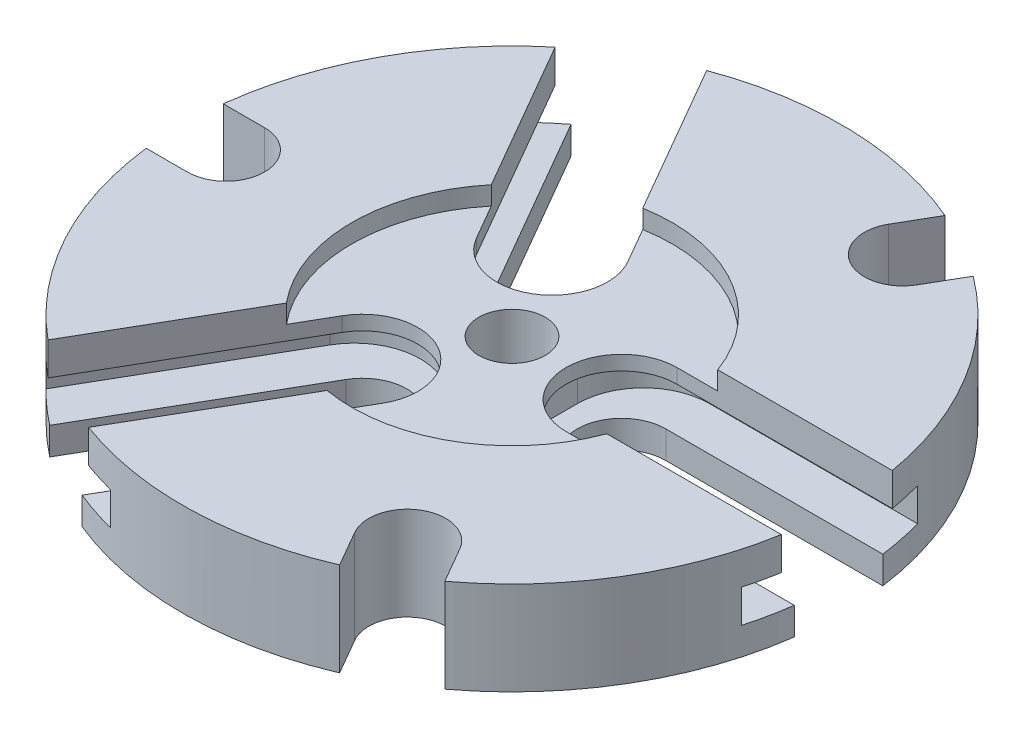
ISO-10303-21;
HEADER;
FILE_DESCRIPTION(('STEP AP214'),'2;1');
FILE_NAME('part.step','',(''),(''),'','','');
FILE_SCHEMA(('AUTOMOTIVE_DESIGN { 1 0 10303 214 1 1 1 1 }'));
ENDSEC;
DATA;
#1=APPLICATION_CONTEXT('core data for automotive mechanical design processes');
#2=APPLICATION_PROTOCOL_DEFINITION('international standard','automotive_design',2000,#1);
#3=PRODUCT_CONTEXT('',#1,'mechanical');
#4=PRODUCT('Part','Part','',(#3));
#5=PRODUCT_RELATED_PRODUCT_CATEGORY('part','',(#4));
#6=PRODUCT_DEFINITION_FORMATION('','',#4);
#7=PRODUCT_DEFINITION_CONTEXT('part definition',#1,'design');
#8=PRODUCT_DEFINITION('design','',#6,#7);
#9=PRODUCT_DEFINITION_SHAPE('','',#8);
#10=(LENGTH_UNIT() NAMED_UNIT(*) SI_UNIT(.MILLI.,.METRE.));
#11=(NAMED_UNIT(*) PLANE_ANGLE_UNIT() SI_UNIT($,.RADIAN.));
#12=(NAMED_UNIT(*) SI_UNIT($,.STERADIAN.) SOLID_ANGLE_UNIT());
#13=UNCERTAINTY_MEASURE_WITH_UNIT(LENGTH_MEASURE(1.E-05),#10,'distance_accuracy_value','');
#14=(GEOMETRIC_REPRESENTATION_CONTEXT(3) GLOBAL_UNCERTAINTY_ASSIGNED_CONTEXT((#13)) GLOBAL_UNIT_ASSIGNED_CONTEXT((#10,
#11,#12)) REPRESENTATION_CONTEXT('',''));
#15=CARTESIAN_POINT('',(0.,0.,0.));
#16=DIRECTION('',(0.,0.,1.));
#17=DIRECTION('',(1.,0.,0.));
#18=AXIS2_PLACEMENT_3D('',#15,#16,#17);
#19=CARTESIAN_POINT('',(0.,6.7437,0.));
#20=DIRECTION('',(0.,-1.,0.));
#21=DIRECTION('',(0.,0.,-1.));
#22=AXIS2_PLACEMENT_3D('',#19,#20,#21);
#23=CYLINDRICAL_SURFACE('',#22,47.5488);
#24=CARTESIAN_POINT('',(0.,-6.7437,0.));
#25=DIRECTION('',(0.,1.,0.));
#26=DIRECTION('',(0.,0.,1.));
#27=AXIS2_PLACEMENT_3D('',#24,#25,#26);
#28=CIRCLE('',#27,47.5488);
#29=CARTESIAN_POINT('',(47.1177308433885,-6.7437,-6.3881));
#30=VERTEX_POINT('',#29);
#31=CARTESIAN_POINT('',(28.4233787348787,-6.7437,-38.1182360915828));
#32=VERTEX_POINT('',#31);
#33=EDGE_CURVE('E866',#30,#32,#28,.T.);
#34=ORIENTED_EDGE('',*,*,#33,.T.);
#35=DIRECTION('',(0.,-1.,0.));
#36=VECTOR('',#35,1.);
#37=CARTESIAN_POINT('',(28.4233787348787,25.7139957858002,-38.1182360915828));
#38=LINE('',#37,#36);
#39=CARTESIAN_POINT('',(28.4233787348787,6.7437,-38.1182360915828));
#40=VERTEX_POINT('',#39);
#41=EDGE_CURVE('E441',#40,#32,#38,.T.);
#42=ORIENTED_EDGE('',*,*,#41,.F.);
#43=CARTESIAN_POINT('',(0.,6.7437,0.));
#44=DIRECTION('',(0.,1.,0.));
#45=DIRECTION('',(0.,0.,1.));
#46=AXIS2_PLACEMENT_3D('',#43,#44,#45);
#47=CIRCLE('',#46,47.5488);
#48=CARTESIAN_POINT('',(46.870805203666,6.7437,-8.001));
#49=VERTEX_POINT('',#48);
#50=EDGE_CURVE('E41',#49,#40,#47,.T.);
#51=ORIENTED_EDGE('',*,*,#50,.F.);
#52=DIRECTION('',(0.,1.,0.));
#53=VECTOR('',#52,1.);
#54=CARTESIAN_POINT('',(46.870805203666,1.9939,-8.001));
#55=LINE('',#54,#53);
#56=CARTESIAN_POINT('',(46.870805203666,1.9939,-8.001));
#57=VERTEX_POINT('',#56);
#58=EDGE_CURVE('E659',#57,#49,#55,.T.);
#59=ORIENTED_EDGE('',*,*,#58,.F.);
#60=CARTESIAN_POINT('',(0.,1.9939,0.));
#61=DIRECTION('',(0.,1.,0.));
#62=DIRECTION('',(0.,0.,1.));
#63=AXIS2_PLACEMENT_3D('',#60,#61,#62);
#64=CIRCLE('',#63,47.5488);
#65=CARTESIAN_POINT('',(45.8213747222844,1.9939,-12.7));
#66=VERTEX_POINT('',#65);
#67=EDGE_CURVE('E629',#57,#66,#64,.T.);
#68=ORIENTED_EDGE('',*,*,#67,.T.);
#69=DIRECTION('',(0.,1.,0.));
#70=VECTOR('',#69,1.);
#71=CARTESIAN_POINT('',(45.8213747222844,-2.7813,-12.7));
#72=LINE('',#71,#70);
#73=CARTESIAN_POINT('',(45.8213747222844,-2.7813,-12.7));
#74=VERTEX_POINT('',#73);
#75=EDGE_CURVE('E793',#74,#66,#72,.T.);
#76=ORIENTED_EDGE('',*,*,#75,.F.);
#77=CARTESIAN_POINT('',(0.,-2.7813,0.));
#78=DIRECTION('',(0.,1.,0.));
#79=DIRECTION('',(0.,0.,1.));
#80=AXIS2_PLACEMENT_3D('',#77,#78,#79);
#81=CIRCLE('',#80,47.5488);
#82=CARTESIAN_POINT('',(47.1177308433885,-2.7813,-6.3881));
#83=VERTEX_POINT('',#82);
#84=EDGE_CURVE('E770',#83,#74,#81,.T.);
#85=ORIENTED_EDGE('',*,*,#84,.F.);
#86=DIRECTION('',(0.,1.,0.));
#87=VECTOR('',#86,1.);
#88=CARTESIAN_POINT('',(47.1177308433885,-6.7437,-6.3881));
#89=LINE('',#88,#87);
#90=EDGE_CURVE('E850',#30,#83,#89,.T.);
#91=ORIENTED_EDGE('',*,*,#90,.F.);
#92=EDGE_LOOP('',(#34,#42,#51,#59,#68,#76,#85,#91));
#93=FACE_BOUND('',#92,.T.);
#94=ADVANCED_FACE('F33',(#93),#23,.T.);
#95=CARTESIAN_POINT('',(-29.0911223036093,-6.7437,-37.6111018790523));
#96=VERTEX_POINT('',#95);
#97=CARTESIAN_POINT('',(-47.223050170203,-6.7437,-5.55624999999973));
#98=VERTEX_POINT('',#97);
#99=EDGE_CURVE('E972',#96,#98,#28,.T.);
#100=ORIENTED_EDGE('',*,*,#99,.T.);
#101=DIRECTION('',(0.,-1.,0.));
#102=VECTOR('',#101,1.);
#103=CARTESIAN_POINT('',(-47.223050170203,22.97446520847,-5.55624999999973));
#104=LINE('',#103,#102);
#105=CARTESIAN_POINT('',(-47.223050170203,6.7437,-5.55624999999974));
#106=VERTEX_POINT('',#105);
#107=EDGE_CURVE('E464',#106,#98,#104,.T.);
#108=ORIENTED_EDGE('',*,*,#107,.F.);
#109=CARTESIAN_POINT('',(-30.3644718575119,6.7437,-36.5908080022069));
#110=VERTEX_POINT('',#109);
#111=EDGE_CURVE('E911',#110,#106,#47,.T.);
#112=ORIENTED_EDGE('',*,*,#111,.F.);
#113=DIRECTION('',(0.,1.,0.));
#114=VECTOR('',#113,1.);
#115=CARTESIAN_POINT('',(-30.3644718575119,1.9939,-36.5908080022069));
#116=LINE('',#115,#114);
#117=CARTESIAN_POINT('',(-30.3644718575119,1.9939,-36.5908080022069));
#118=VERTEX_POINT('',#117);
#119=EDGE_CURVE('E575',#118,#110,#116,.T.);
#120=ORIENTED_EDGE('',*,*,#119,.F.);
#121=CARTESIAN_POINT('',(0.,1.9939,0.));
#122=DIRECTION('',(0.,1.,0.));
#123=DIRECTION('',(0.866025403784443,0.,-0.499999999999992));
#124=AXIS2_PLACEMENT_3D('',#121,#122,#123);
#125=CIRCLE('',#124,47.5488);
#126=CARTESIAN_POINT('',(-33.9092099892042,1.9939,-33.3324745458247));
#127=VERTEX_POINT('',#126);
#128=EDGE_CURVE('E545',#118,#127,#125,.T.);
#129=ORIENTED_EDGE('',*,*,#128,.T.);
#130=DIRECTION('',(0.,1.,0.));
#131=VECTOR('',#130,1.);
#132=CARTESIAN_POINT('',(-33.9092099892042,-2.7813,-33.3324745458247));
#133=LINE('',#132,#131);
#134=CARTESIAN_POINT('',(-33.9092099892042,-2.7813,-33.3324745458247));
#135=VERTEX_POINT('',#134);
#136=EDGE_CURVE('E707',#135,#127,#133,.T.);
#137=ORIENTED_EDGE('',*,*,#136,.F.);
#138=CARTESIAN_POINT('',(0.,-2.7813,0.));
#139=DIRECTION('',(0.,1.,0.));
#140=DIRECTION('',(0.866025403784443,0.,-0.499999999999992));
#141=AXIS2_PLACEMENT_3D('',#138,#139,#140);
#142=CIRCLE('',#141,47.5488);
#143=CARTESIAN_POINT('',(-29.0911223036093,-2.7813,-37.6111018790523));
#144=VERTEX_POINT('',#143);
#145=EDGE_CURVE('E684',#144,#135,#142,.T.);
#146=ORIENTED_EDGE('',*,*,#145,.F.);
#147=DIRECTION('',(0.,1.,0.));
#148=VECTOR('',#147,1.);
#149=CARTESIAN_POINT('',(-29.0911223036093,-6.7437,-37.6111018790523));
#150=LINE('',#149,#148);
#151=EDGE_CURVE('E808',#96,#144,#150,.T.);
#152=ORIENTED_EDGE('',*,*,#151,.F.);
#153=EDGE_LOOP('',(#100,#108,#112,#120,#129,#137,#146,#152));
#154=FACE_BOUND('',#153,.T.);
#155=ADVANCED_FACE('F945',(#154),#23,.T.);
#156=CARTESIAN_POINT('',(-18.0266085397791,-6.7437,43.9992018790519));
#157=VERTEX_POINT('',#156);
#158=CARTESIAN_POINT('',(18.7996714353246,-6.7437,43.6744860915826));
#159=VERTEX_POINT('',#158);
#160=EDGE_CURVE('E870',#157,#159,#28,.T.);
#161=ORIENTED_EDGE('',*,*,#160,.T.);
#162=DIRECTION('',(0.,-1.,0.));
#163=VECTOR('',#162,1.);
#164=CARTESIAN_POINT('',(18.7996714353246,25.7139957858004,43.6744860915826));
#165=LINE('',#164,#163);
#166=CARTESIAN_POINT('',(18.7996714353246,6.7437,43.6744860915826));
#167=VERTEX_POINT('',#166);
#168=EDGE_CURVE('E489',#167,#159,#165,.T.);
#169=ORIENTED_EDGE('',*,*,#168,.F.);
#170=CARTESIAN_POINT('',(-16.5063333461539,6.7437,44.5918080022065));
#171=VERTEX_POINT('',#170);
#172=EDGE_CURVE('E865',#171,#167,#47,.T.);
#173=ORIENTED_EDGE('',*,*,#172,.F.);
#174=DIRECTION('',(0.,1.,0.));
#175=VECTOR('',#174,1.);
#176=CARTESIAN_POINT('',(-16.5063333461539,1.9939,44.5918080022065));
#177=LINE('',#176,#175);
#178=CARTESIAN_POINT('',(-16.5063333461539,1.9939,44.5918080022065));
#179=VERTEX_POINT('',#178);
#180=EDGE_CURVE('E617',#179,#171,#177,.T.);
#181=ORIENTED_EDGE('',*,*,#180,.F.);
#182=CARTESIAN_POINT('',(0.,1.9939,0.));
#183=DIRECTION('',(0.,1.,0.));
#184=DIRECTION('',(-0.866025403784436,0.,-0.500000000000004));
#185=AXIS2_PLACEMENT_3D('',#182,#183,#184);
#186=CIRCLE('',#185,47.5488);
#187=CARTESIAN_POINT('',(-11.91216473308,1.9939,46.0324745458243));
#188=VERTEX_POINT('',#187);
#189=EDGE_CURVE('E587',#179,#188,#186,.T.);
#190=ORIENTED_EDGE('',*,*,#189,.T.);
#191=DIRECTION('',(0.,1.,0.));
#192=VECTOR('',#191,1.);
#193=CARTESIAN_POINT('',(-11.91216473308,-2.7813,46.0324745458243));
#194=LINE('',#193,#192);
#195=CARTESIAN_POINT('',(-11.91216473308,-2.7813,46.0324745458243));
#196=VERTEX_POINT('',#195);
#197=EDGE_CURVE('E750',#196,#188,#194,.T.);
#198=ORIENTED_EDGE('',*,*,#197,.F.);
#199=CARTESIAN_POINT('',(0.,-2.7813,0.));
#200=DIRECTION('',(0.,1.,0.));
#201=DIRECTION('',(-0.866025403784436,0.,-0.500000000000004));
#202=AXIS2_PLACEMENT_3D('',#199,#200,#201);
#203=CIRCLE('',#202,47.5488);
#204=CARTESIAN_POINT('',(-18.0266085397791,-2.7813,43.9992018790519));
#205=VERTEX_POINT('',#204);
#206=EDGE_CURVE('E727',#205,#196,#203,.T.);
#207=ORIENTED_EDGE('',*,*,#206,.F.);
#208=DIRECTION('',(0.,1.,0.));
#209=VECTOR('',#208,1.);
#210=CARTESIAN_POINT('',(-18.0266085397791,-6.7437,43.9992018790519));
#211=LINE('',#210,#209);
#212=EDGE_CURVE('E829',#157,#205,#211,.T.);
#213=ORIENTED_EDGE('',*,*,#212,.F.);
#214=EDGE_LOOP('',(#161,#169,#173,#181,#190,#198,#207,#213));
#215=FACE_BOUND('',#214,.T.);
#216=ADVANCED_FACE('F1024',(#215),#23,.T.);
#217=CARTESIAN_POINT('',(0.,6.7437,0.));
#218=DIRECTION('',(0.,1.,0.));
#219=DIRECTION('',(0.,0.,1.));
#220=AXIS2_PLACEMENT_3D('',#217,#218,#219);
#221=PLANE('',#220);
#222=DIRECTION('',(-0.500000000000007,0.,0.866025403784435));
#223=VECTOR('',#222,1.);
#224=CARTESIAN_POINT('',(25.4493536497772,6.7437,-32.9670735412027));
#225=LINE('',#224,#223);
#226=CARTESIAN_POINT('',(25.4493536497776,6.7437,-32.9670735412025));
#227=VERTEX_POINT('',#226);
#228=EDGE_CURVE('E422',#40,#227,#225,.T.);
#229=ORIENTED_EDGE('',*,*,#228,.T.);
#230=CARTESIAN_POINT('',(20.6375000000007,6.7437,-35.7451985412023));
#231=DIRECTION('',(0.,1.,0.));
#232=DIRECTION('',(0.,0.,1.));
#233=AXIS2_PLACEMENT_3D('',#230,#231,#232);
#234=CIRCLE('',#233,5.55624999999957);
#235=CARTESIAN_POINT('',(15.8256463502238,6.7437,-38.5233235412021));
#236=VERTEX_POINT('',#235);
#237=EDGE_CURVE('E410',#227,#236,#234,.F.);
#238=ORIENTED_EDGE('',*,*,#237,.T.);
#239=DIRECTION('',(0.500000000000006,0.,-0.866025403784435));
#240=VECTOR('',#239,1.);
#241=CARTESIAN_POINT('',(15.8256463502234,6.7437,-38.5233235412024));
#242=LINE('',#241,#240);
#243=CARTESIAN_POINT('',(18.7996714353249,6.7437,-43.6744860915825));
#244=VERTEX_POINT('',#243);
#245=EDGE_CURVE('E436',#236,#244,#242,.T.);
#246=ORIENTED_EDGE('',*,*,#245,.T.);
#247=CARTESIAN_POINT('',(-16.5063333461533,6.7437,-44.5918080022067));
#248=VERTEX_POINT('',#247);
#249=EDGE_CURVE('E864',#244,#248,#47,.T.);
#250=ORIENTED_EDGE('',*,*,#249,.T.);
#251=DIRECTION('',(0.499999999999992,0.,0.866025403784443));
#252=VECTOR('',#251,1.);
#253=CARTESIAN_POINT('',(-16.5063333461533,6.7437,-44.5918080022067));
#254=LINE('',#253,#252);
#255=CARTESIAN_POINT('',(-3.91345115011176,6.7437,-22.7802962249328));
#256=VERTEX_POINT('',#255);
#257=EDGE_CURVE('E544',#248,#256,#254,.T.);
#258=ORIENTED_EDGE('',*,*,#257,.T.);
#259=CARTESIAN_POINT('',(0.,6.7437,0.));
#260=DIRECTION('',(0.,1.,0.));
#261=DIRECTION('',(0.,0.,1.));
#262=AXIS2_PLACEMENT_3D('',#259,#260,#261);
#263=CIRCLE('',#262,23.114);
#264=CARTESIAN_POINT('',(21.6850408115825,6.7437,-8.001));
#265=VERTEX_POINT('',#264);
#266=EDGE_CURVE('E499',#265,#256,#263,.T.);
#267=ORIENTED_EDGE('',*,*,#266,.F.);
#268=DIRECTION('',(1.,0.,0.));
#269=VECTOR('',#268,1.);
#270=CARTESIAN_POINT('',(46.870805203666,6.7437,-8.001));
#271=LINE('',#270,#269);
#272=EDGE_CURVE('E633',#265,#49,#271,.T.);
#273=ORIENTED_EDGE('',*,*,#272,.T.);
#274=ORIENTED_EDGE('',*,*,#50,.T.);
#275=EDGE_LOOP('',(#229,#238,#246,#250,#258,#267,#273,#274));
#276=FACE_BOUND('',#275,.T.);
#277=ADVANCED_FACE('F428',(#276),#221,.T.);
#278=DIRECTION('',(1.,0.,0.));
#279=VECTOR('',#278,1.);
#280=CARTESIAN_POINT('',(-41.275,6.7437,-5.55624999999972));
#281=LINE('',#280,#279);
#282=CARTESIAN_POINT('',(-41.275,6.7437,-5.55625000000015));
#283=VERTEX_POINT('',#282);
#284=EDGE_CURVE('E447',#106,#283,#281,.T.);
#285=ORIENTED_EDGE('',*,*,#284,.T.);
#286=CARTESIAN_POINT('',(-41.275,6.7437,-5.72458747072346E-13));
#287=DIRECTION('',(0.,1.,0.));
#288=DIRECTION('',(0.,0.,1.));
#289=AXIS2_PLACEMENT_3D('',#286,#287,#288);
#290=CIRCLE('',#289,5.55624999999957);
#291=CARTESIAN_POINT('',(-41.275,6.7437,5.556249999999));
#292=VERTEX_POINT('',#291);
#293=EDGE_CURVE('E459',#283,#292,#290,.F.);
#294=ORIENTED_EDGE('',*,*,#293,.T.);
#295=DIRECTION('',(-1.,0.,0.));
#296=VECTOR('',#295,1.);
#297=CARTESIAN_POINT('',(-41.275,6.7437,5.55624999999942));
#298=LINE('',#297,#296);
#299=CARTESIAN_POINT('',(-47.223050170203,6.7437,5.55624999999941));
#300=VERTEX_POINT('',#299);
#301=EDGE_CURVE('E454',#292,#300,#298,.T.);
#302=ORIENTED_EDGE('',*,*,#301,.T.);
#303=CARTESIAN_POINT('',(-30.3644718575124,6.7437,36.5908080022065));
#304=VERTEX_POINT('',#303);
#305=EDGE_CURVE('E912',#300,#304,#47,.T.);
#306=ORIENTED_EDGE('',*,*,#305,.T.);
#307=DIRECTION('',(0.500000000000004,0.,-0.866025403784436));
#308=VECTOR('',#307,1.);
#309=CARTESIAN_POINT('',(-30.3644718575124,6.7437,36.5908080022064));
#310=LINE('',#309,#308);
#311=CARTESIAN_POINT('',(-17.7715896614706,6.7437,14.7792962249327));
#312=VERTEX_POINT('',#311);
#313=EDGE_CURVE('E578',#304,#312,#310,.T.);
#314=ORIENTED_EDGE('',*,*,#313,.T.);
#315=CARTESIAN_POINT('',(-17.7715896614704,6.7437,-14.779296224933));
#316=VERTEX_POINT('',#315);
#317=EDGE_CURVE('E502',#316,#312,#263,.T.);
#318=ORIENTED_EDGE('',*,*,#317,.F.);
#319=DIRECTION('',(-0.499999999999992,0.,-0.866025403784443));
#320=VECTOR('',#319,1.);
#321=CARTESIAN_POINT('',(-30.3644718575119,6.7437,-36.5908080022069));
#322=LINE('',#321,#320);
#323=EDGE_CURVE('E549',#316,#110,#322,.T.);
#324=ORIENTED_EDGE('',*,*,#323,.T.);
#325=ORIENTED_EDGE('',*,*,#111,.T.);
#326=EDGE_LOOP('',(#285,#294,#302,#306,#314,#318,#324,#325));
#327=FACE_BOUND('',#326,.T.);
#328=ADVANCED_FACE('F936',(#327),#221,.T.);
#329=CARTESIAN_POINT('',(15.7988,1.9939,0.));
#330=DIRECTION('',(0.,1.,0.));
#331=DIRECTION('',(0.,0.,1.));
#332=AXIS2_PLACEMENT_3D('',#329,#330,#331);
#333=CYLINDRICAL_SURFACE('',#332,8.001);
#334=DIRECTION('',(0.,1.,0.));
#335=VECTOR('',#334,1.);
#336=CARTESIAN_POINT('',(15.7988,1.9939,-8.001));
#337=LINE('',#336,#335);
#338=CARTESIAN_POINT('',(15.7988,1.9939,-8.001));
#339=VERTEX_POINT('',#338);
#340=CARTESIAN_POINT('',(15.7988,4.0767,-8.001));
#341=VERTEX_POINT('',#340);
#342=EDGE_CURVE('E663',#339,#341,#337,.T.);
#343=ORIENTED_EDGE('',*,*,#342,.T.);
#344=CARTESIAN_POINT('',(15.7988,4.0767,0.));
#345=DIRECTION('',(0.,1.,0.));
#346=DIRECTION('',(0.,0.,1.));
#347=AXIS2_PLACEMENT_3D('',#344,#345,#346);
#348=CIRCLE('',#347,8.001);
#349=CARTESIAN_POINT('',(15.7988,4.0767,8.001));
#350=VERTEX_POINT('',#349);
#351=EDGE_CURVE('E525',#341,#350,#348,.T.);
#352=ORIENTED_EDGE('',*,*,#351,.T.);
#353=DIRECTION('',(0.,1.,0.));
#354=VECTOR('',#353,1.);
#355=CARTESIAN_POINT('',(15.7988,1.9939,8.001));
#356=LINE('',#355,#354);
#357=CARTESIAN_POINT('',(15.7988,1.9939,8.001));
#358=VERTEX_POINT('',#357);
#359=EDGE_CURVE('E666',#358,#350,#356,.T.);
#360=ORIENTED_EDGE('',*,*,#359,.F.);
#361=CARTESIAN_POINT('',(15.7988,1.9939,0.));
#362=DIRECTION('',(0.,-1.,0.));
#363=DIRECTION('',(0.,0.,1.));
#364=AXIS2_PLACEMENT_3D('',#361,#362,#363);
#365=CIRCLE('',#364,8.001);
#366=EDGE_CURVE('E649',#358,#339,#365,.T.);
#367=ORIENTED_EDGE('',*,*,#366,.T.);
#368=EDGE_LOOP('',(#343,#352,#360,#367));
#369=FACE_BOUND('',#368,.T.);
#370=ADVANCED_FACE('F922',(#369),#333,.F.);
#371=CARTESIAN_POINT('',(-7.89940000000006,1.9939,13.6821621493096));
#372=DIRECTION('',(0.,1.,0.));
#373=DIRECTION('',(0.,0.,1.));
#374=AXIS2_PLACEMENT_3D('',#371,#372,#373);
#375=CYLINDRICAL_SURFACE('',#374,8.001);
#376=DIRECTION('',(0.,1.,0.));
#377=VECTOR('',#376,1.);
#378=CARTESIAN_POINT('',(-0.970330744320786,1.9939,17.6826621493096));
#379=LINE('',#378,#377);
#380=CARTESIAN_POINT('',(-0.970330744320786,1.9939,17.6826621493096));
#381=VERTEX_POINT('',#380);
#382=CARTESIAN_POINT('',(-0.970330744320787,4.0767,17.6826621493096));
#383=VERTEX_POINT('',#382);
#384=EDGE_CURVE('E621',#381,#383,#379,.T.);
#385=ORIENTED_EDGE('',*,*,#384,.T.);
#386=CARTESIAN_POINT('',(-7.89940000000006,4.0767,13.6821621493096));
#387=DIRECTION('',(0.,1.,0.));
#388=DIRECTION('',(0.,0.,1.));
#389=AXIS2_PLACEMENT_3D('',#386,#387,#388);
#390=CIRCLE('',#389,8.001);
#391=CARTESIAN_POINT('',(-14.8284692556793,4.0767,9.68166214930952));
#392=VERTEX_POINT('',#391);
#393=EDGE_CURVE('E516',#383,#392,#390,.T.);
#394=ORIENTED_EDGE('',*,*,#393,.T.);
#395=DIRECTION('',(0.,1.,0.));
#396=VECTOR('',#395,1.);
#397=CARTESIAN_POINT('',(-14.8284692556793,1.9939,9.68166214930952));
#398=LINE('',#397,#396);
#399=CARTESIAN_POINT('',(-14.8284692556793,1.9939,9.68166214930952));
#400=VERTEX_POINT('',#399);
#401=EDGE_CURVE('E624',#400,#392,#398,.T.);
#402=ORIENTED_EDGE('',*,*,#401,.F.);
#403=CARTESIAN_POINT('',(-7.89940000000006,1.9939,13.6821621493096));
#404=DIRECTION('',(0.,-1.,0.));
#405=DIRECTION('',(-0.866025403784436,0.,-0.500000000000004));
#406=AXIS2_PLACEMENT_3D('',#403,#404,#405);
#407=CIRCLE('',#406,8.001);
#408=EDGE_CURVE('E607',#400,#381,#407,.T.);
#409=ORIENTED_EDGE('',*,*,#408,.T.);
#410=EDGE_LOOP('',(#385,#394,#402,#409));
#411=FACE_BOUND('',#410,.T.);
#412=ADVANCED_FACE('F888',(#411),#375,.F.);
#413=CARTESIAN_POINT('',(-7.89939999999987,1.9939,-13.6821621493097));
#414=DIRECTION('',(0.,1.,0.));
#415=DIRECTION('',(0.,0.,1.));
#416=AXIS2_PLACEMENT_3D('',#413,#414,#415);
#417=CYLINDRICAL_SURFACE('',#416,8.001);
#418=DIRECTION('',(0.,1.,0.));
#419=VECTOR('',#418,1.);
#420=CARTESIAN_POINT('',(-14.8284692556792,1.9939,-9.68166214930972));
#421=LINE('',#420,#419);
#422=CARTESIAN_POINT('',(-14.8284692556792,1.9939,-9.68166214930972));
#423=VERTEX_POINT('',#422);
#424=CARTESIAN_POINT('',(-14.8284692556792,4.0767,-9.68166214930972));
#425=VERTEX_POINT('',#424);
#426=EDGE_CURVE('E579',#423,#425,#421,.T.);
#427=ORIENTED_EDGE('',*,*,#426,.T.);
#428=CARTESIAN_POINT('',(-7.89939999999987,4.0767,-13.6821621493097));
#429=DIRECTION('',(0.,1.,0.));
#430=DIRECTION('',(0.,0.,1.));
#431=AXIS2_PLACEMENT_3D('',#428,#429,#430);
#432=CIRCLE('',#431,8.001);
#433=CARTESIAN_POINT('',(-0.970330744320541,4.0767,-17.6826621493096));
#434=VERTEX_POINT('',#433);
#435=EDGE_CURVE('E506',#425,#434,#432,.T.);
#436=ORIENTED_EDGE('',*,*,#435,.T.);
#437=DIRECTION('',(0.,1.,0.));
#438=VECTOR('',#437,1.);
#439=CARTESIAN_POINT('',(-0.970330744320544,1.9939,-17.6826621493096));
#440=LINE('',#439,#438);
#441=CARTESIAN_POINT('',(-0.970330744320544,1.9939,-17.6826621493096));
#442=VERTEX_POINT('',#441);
#443=EDGE_CURVE('E582',#442,#434,#440,.T.);
#444=ORIENTED_EDGE('',*,*,#443,.F.);
#445=CARTESIAN_POINT('',(-7.89939999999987,1.9939,-13.6821621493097));
#446=DIRECTION('',(0.,-1.,0.));
#447=DIRECTION('',(0.866025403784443,0.,-0.499999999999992));
#448=AXIS2_PLACEMENT_3D('',#445,#446,#447);
#449=CIRCLE('',#448,8.001);
#450=EDGE_CURVE('E565',#442,#423,#449,.T.);
#451=ORIENTED_EDGE('',*,*,#450,.T.);
#452=EDGE_LOOP('',(#427,#436,#444,#451));
#453=FACE_BOUND('',#452,.T.);
#454=ADVANCED_FACE('F1049',(#453),#417,.F.);
#455=CARTESIAN_POINT('',(0.,-6.7437,0.));
#456=DIRECTION('',(0.,1.,0.));
#457=DIRECTION('',(0.,0.,1.));
#458=AXIS2_PLACEMENT_3D('',#455,#456,#457);
#459=CYLINDRICAL_SURFACE('',#458,4.7879);
#460=CARTESIAN_POINT('',(0.,-6.7437,0.));
#461=DIRECTION('',(0.,1.,0.));
#462=DIRECTION('',(0.,0.,1.));
#463=AXIS2_PLACEMENT_3D('',#460,#461,#462);
#464=CIRCLE('',#463,4.7879);
#465=CARTESIAN_POINT('',(0.,-6.7437,4.7879));
#466=VERTEX_POINT('',#465);
#467=EDGE_CURVE('E541',#466,#466,#464,.T.);
#468=ORIENTED_EDGE('',*,*,#467,.F.);
#469=EDGE_LOOP('',(#468));
#470=FACE_BOUND('',#469,.T.);
#471=CARTESIAN_POINT('',(0.,4.0767,0.));
#472=DIRECTION('',(0.,1.,0.));
#473=DIRECTION('',(0.,0.,1.));
#474=AXIS2_PLACEMENT_3D('',#471,#472,#473);
#475=CIRCLE('',#474,4.7879);
#476=CARTESIAN_POINT('',(0.,4.0767,4.7879));
#477=VERTEX_POINT('',#476);
#478=EDGE_CURVE('E507',#477,#477,#475,.F.);
#479=ORIENTED_EDGE('',*,*,#478,.F.);
#480=EDGE_LOOP('',(#479));
#481=FACE_BOUND('',#480,.T.);
#482=ADVANCED_FACE('F1096',(#470,#481),#459,.F.);
#483=CARTESIAN_POINT('',(-5.14976934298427,-2.7813,-15.2696621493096));
#484=DIRECTION('',(0.,1.,0.));
#485=DIRECTION('',(0.,0.,1.));
#486=AXIS2_PLACEMENT_3D('',#483,#484,#485);
#487=CYLINDRICAL_SURFACE('',#486,9.525);
#488=CARTESIAN_POINT('',(-5.14976934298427,1.9939,-15.2696621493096));
#489=DIRECTION('',(0.,1.,0.));
#490=DIRECTION('',(0.866025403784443,0.,-0.499999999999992));
#491=AXIS2_PLACEMENT_3D('',#488,#489,#490);
#492=CIRCLE('',#491,9.525);
#493=CARTESIAN_POINT('',(-0.387269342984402,1.9939,-7.02077017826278));
#494=VERTEX_POINT('',#493);
#495=CARTESIAN_POINT('',(3.09912262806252,1.9939,-20.0321621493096));
#496=VERTEX_POINT('',#495);
#497=EDGE_CURVE('E555',#494,#496,#492,.T.);
#498=ORIENTED_EDGE('',*,*,#497,.T.);
#499=DIRECTION('',(0.,1.,0.));
#500=VECTOR('',#499,1.);
#501=CARTESIAN_POINT('',(3.09912262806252,-2.7813,-20.0321621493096));
#502=LINE('',#501,#500);
#503=CARTESIAN_POINT('',(3.09912262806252,-2.7813,-20.0321621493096));
#504=VERTEX_POINT('',#503);
#505=EDGE_CURVE('E696',#504,#496,#502,.T.);
#506=ORIENTED_EDGE('',*,*,#505,.F.);
#507=CARTESIAN_POINT('',(-5.14976934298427,-2.7813,-15.2696621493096));
#508=DIRECTION('',(0.,1.,0.));
#509=DIRECTION('',(-0.866025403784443,0.,0.499999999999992));
#510=AXIS2_PLACEMENT_3D('',#507,#508,#509);
#511=CIRCLE('',#510,9.525);
#512=CARTESIAN_POINT('',(-0.387269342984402,-2.7813,-7.02077017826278));
#513=VERTEX_POINT('',#512);
#514=EDGE_CURVE('E662',#513,#504,#511,.T.);
#515=ORIENTED_EDGE('',*,*,#514,.F.);
#516=DIRECTION('',(0.,1.,0.));
#517=VECTOR('',#516,1.);
#518=CARTESIAN_POINT('',(-0.387269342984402,-2.7813,-7.02077017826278));
#519=LINE('',#518,#517);
#520=EDGE_CURVE('E697',#513,#494,#519,.T.);
#521=ORIENTED_EDGE('',*,*,#520,.T.);
#522=EDGE_LOOP('',(#498,#506,#515,#521));
#523=FACE_BOUND('',#522,.T.);
#524=ADVANCED_FACE('F1099',(#523),#487,.F.);
#525=CARTESIAN_POINT('',(-5.8865306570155,-2.7813,-3.8457701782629));
#526=DIRECTION('',(0.499999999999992,0.,0.866025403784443));
#527=DIRECTION('',(0.866025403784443,0.,-0.499999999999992));
#528=AXIS2_PLACEMENT_3D('',#525,#526,#527);
#529=PLANE('',#528);
#530=DIRECTION('',(0.866025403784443,0.,-0.499999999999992));
#531=VECTOR('',#530,1.);
#532=CARTESIAN_POINT('',(-5.8865306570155,1.9939,-3.8457701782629));
#533=LINE('',#532,#531);
#534=CARTESIAN_POINT('',(-5.8865306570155,1.9939,-3.8457701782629));
#535=VERTEX_POINT('',#534);
#536=EDGE_CURVE('E553',#535,#494,#533,.T.);
#537=ORIENTED_EDGE('',*,*,#536,.T.);
#538=ORIENTED_EDGE('',*,*,#520,.F.);
#539=DIRECTION('',(0.866025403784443,0.,-0.499999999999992));
#540=VECTOR('',#539,1.);
#541=CARTESIAN_POINT('',(-5.8865306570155,-2.7813,-3.8457701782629));
#542=LINE('',#541,#540);
#543=CARTESIAN_POINT('',(-5.8865306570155,-2.7813,-3.8457701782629));
#544=VERTEX_POINT('',#543);
#545=EDGE_CURVE('E693',#544,#513,#542,.T.);
#546=ORIENTED_EDGE('',*,*,#545,.F.);
#547=DIRECTION('',(0.,1.,0.));
#548=VECTOR('',#547,1.);
#549=CARTESIAN_POINT('',(-5.8865306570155,-2.7813,-3.8457701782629));
#550=LINE('',#549,#548);
#551=EDGE_CURVE('E701',#544,#535,#550,.T.);
#552=ORIENTED_EDGE('',*,*,#551,.T.);
#553=EDGE_LOOP('',(#537,#538,#546,#552));
#554=FACE_BOUND('',#553,.T.);
#555=ADVANCED_FACE('F1105',(#554),#529,.F.);
#556=CARTESIAN_POINT('',(-10.6490306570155,-2.7813,-12.0946621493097));
#557=DIRECTION('',(0.,1.,0.));
#558=DIRECTION('',(0.,0.,1.));
#559=AXIS2_PLACEMENT_3D('',#556,#557,#558);
#560=CYLINDRICAL_SURFACE('',#559,9.525);
#561=CARTESIAN_POINT('',(-10.6490306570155,1.9939,-12.0946621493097));
#562=DIRECTION('',(0.,1.,0.));
#563=DIRECTION('',(0.866025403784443,0.,-0.499999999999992));
#564=AXIS2_PLACEMENT_3D('',#561,#562,#563);
#565=CIRCLE('',#564,9.525);
#566=CARTESIAN_POINT('',(-18.8979226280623,1.9939,-7.33216214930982));
#567=VERTEX_POINT('',#566);
#568=EDGE_CURVE('E551',#567,#535,#565,.T.);
#569=ORIENTED_EDGE('',*,*,#568,.T.);
#570=ORIENTED_EDGE('',*,*,#551,.F.);
#571=CARTESIAN_POINT('',(-10.6490306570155,-2.7813,-12.0946621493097));
#572=DIRECTION('',(0.,1.,0.));
#573=DIRECTION('',(0.866025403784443,0.,-0.499999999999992));
#574=AXIS2_PLACEMENT_3D('',#571,#572,#573);
#575=CIRCLE('',#574,9.525);
#576=CARTESIAN_POINT('',(-18.8979226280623,-2.7813,-7.33216214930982));
#577=VERTEX_POINT('',#576);
#578=EDGE_CURVE('E690',#577,#544,#575,.T.);
#579=ORIENTED_EDGE('',*,*,#578,.F.);
#580=DIRECTION('',(0.,1.,0.));
#581=VECTOR('',#580,1.);
#582=CARTESIAN_POINT('',(-18.8979226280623,-2.7813,-7.33216214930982));
#583=LINE('',#582,#581);
#584=EDGE_CURVE('E704',#577,#567,#583,.T.);
#585=ORIENTED_EDGE('',*,*,#584,.T.);
#586=EDGE_LOOP('',(#569,#570,#579,#585));
#587=FACE_BOUND('',#586,.T.);
#588=ADVANCED_FACE('F958',(#587),#560,.F.);
#589=CARTESIAN_POINT('',(-18.8979226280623,-2.7813,-7.33216214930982));
#590=DIRECTION('',(-0.866025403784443,0.,0.499999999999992));
#591=DIRECTION('',(0.499999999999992,0.,0.866025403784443));
#592=AXIS2_PLACEMENT_3D('',#589,#590,#591);
#593=PLANE('',#592);
#594=DIRECTION('',(0.499999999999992,0.,0.866025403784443));
#595=VECTOR('',#594,1.);
#596=CARTESIAN_POINT('',(-33.9092099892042,1.9939,-33.3324745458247));
#597=LINE('',#596,#595);
#598=EDGE_CURVE('E548',#127,#567,#597,.T.);
#599=ORIENTED_EDGE('',*,*,#598,.T.);
#600=ORIENTED_EDGE('',*,*,#584,.F.);
#601=DIRECTION('',(0.499999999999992,0.,0.866025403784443));
#602=VECTOR('',#601,1.);
#603=CARTESIAN_POINT('',(-18.8979226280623,-2.7813,-7.33216214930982));
#604=LINE('',#603,#602);
#605=EDGE_CURVE('E687',#135,#577,#604,.T.);
#606=ORIENTED_EDGE('',*,*,#605,.F.);
#607=ORIENTED_EDGE('',*,*,#136,.T.);
#608=EDGE_LOOP('',(#599,#600,#606,#607));
#609=FACE_BOUND('',#608,.T.);
#610=ADVANCED_FACE('F955',(#609),#593,.F.);
#611=CARTESIAN_POINT('',(3.09912262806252,-2.7813,-20.0321621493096));
#612=DIRECTION('',(0.866025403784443,0.,-0.499999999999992));
#613=DIRECTION('',(-0.499999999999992,0.,-0.866025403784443));
#614=AXIS2_PLACEMENT_3D('',#611,#612,#613);
#615=PLANE('',#614);
#616=DIRECTION('',(-0.499999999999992,0.,-0.866025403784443));
#617=VECTOR('',#616,1.);
#618=CARTESIAN_POINT('',(3.09912262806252,1.9939,-20.0321621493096));
#619=LINE('',#618,#617);
#620=CARTESIAN_POINT('',(-11.9121647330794,1.9939,-46.0324745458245));
#621=VERTEX_POINT('',#620);
#622=EDGE_CURVE('E557',#496,#621,#619,.T.);
#623=ORIENTED_EDGE('',*,*,#622,.T.);
#624=DIRECTION('',(0.,1.,0.));
#625=VECTOR('',#624,1.);
#626=CARTESIAN_POINT('',(-11.9121647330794,-2.7813,-46.0324745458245));
#627=LINE('',#626,#625);
#628=CARTESIAN_POINT('',(-11.9121647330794,-2.7813,-46.0324745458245));
#629=VERTEX_POINT('',#628);
#630=EDGE_CURVE('E709',#629,#621,#627,.T.);
#631=ORIENTED_EDGE('',*,*,#630,.F.);
#632=DIRECTION('',(-0.499999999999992,0.,-0.866025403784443));
#633=VECTOR('',#632,1.);
#634=CARTESIAN_POINT('',(3.09912262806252,-2.7813,-20.0321621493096));
#635=LINE('',#634,#633);
#636=EDGE_CURVE('E673',#504,#629,#635,.T.);
#637=ORIENTED_EDGE('',*,*,#636,.F.);
#638=ORIENTED_EDGE('',*,*,#505,.T.);
#639=EDGE_LOOP('',(#623,#631,#637,#638));
#640=FACE_BOUND('',#639,.T.);
#641=ADVANCED_FACE('F1053',(#640),#615,.F.);
#642=CARTESIAN_POINT('',(-10.6490306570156,-2.7813,12.0946621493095));
#643=DIRECTION('',(0.,1.,0.));
#644=DIRECTION('',(0.,0.,1.));
#645=AXIS2_PLACEMENT_3D('',#642,#643,#644);
#646=CYLINDRICAL_SURFACE('',#645,9.525);
#647=CARTESIAN_POINT('',(-10.6490306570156,1.9939,12.0946621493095));
#648=DIRECTION('',(0.,1.,0.));
#649=DIRECTION('',(-0.866025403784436,0.,-0.500000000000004));
#650=AXIS2_PLACEMENT_3D('',#647,#648,#649);
#651=CIRCLE('',#650,9.525);
#652=CARTESIAN_POINT('',(-5.88653065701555,1.9939,3.84577017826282));
#653=VERTEX_POINT('',#652);
#654=CARTESIAN_POINT('',(-18.8979226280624,1.9939,7.33216214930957));
#655=VERTEX_POINT('',#654);
#656=EDGE_CURVE('E597',#653,#655,#651,.T.);
#657=ORIENTED_EDGE('',*,*,#656,.T.);
#658=DIRECTION('',(0.,1.,0.));
#659=VECTOR('',#658,1.);
#660=CARTESIAN_POINT('',(-18.8979226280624,-2.7813,7.33216214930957));
#661=LINE('',#660,#659);
#662=CARTESIAN_POINT('',(-18.8979226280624,-2.7813,7.33216214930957));
#663=VERTEX_POINT('',#662);
#664=EDGE_CURVE('E739',#663,#655,#661,.T.);
#665=ORIENTED_EDGE('',*,*,#664,.F.);
#666=CARTESIAN_POINT('',(-10.6490306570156,-2.7813,12.0946621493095));
#667=DIRECTION('',(0.,1.,0.));
#668=DIRECTION('',(0.866025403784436,0.,0.500000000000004));
#669=AXIS2_PLACEMENT_3D('',#666,#667,#668);
#670=CIRCLE('',#669,9.525);
#671=CARTESIAN_POINT('',(-5.88653065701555,-2.7813,3.84577017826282));
#672=VERTEX_POINT('',#671);
#673=EDGE_CURVE('E700',#672,#663,#670,.T.);
#674=ORIENTED_EDGE('',*,*,#673,.F.);
#675=DIRECTION('',(0.,1.,0.));
#676=VECTOR('',#675,1.);
#677=CARTESIAN_POINT('',(-5.88653065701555,-2.7813,3.84577017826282));
#678=LINE('',#677,#676);
#679=EDGE_CURVE('E740',#672,#653,#678,.T.);
#680=ORIENTED_EDGE('',*,*,#679,.T.);
#681=EDGE_LOOP('',(#657,#665,#674,#680));
#682=FACE_BOUND('',#681,.T.);
#683=ADVANCED_FACE('F1145',(#682),#646,.F.);
#684=CARTESIAN_POINT('',(-0.387269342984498,-2.7813,7.02077017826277));
#685=DIRECTION('',(0.500000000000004,0.,-0.866025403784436));
#686=DIRECTION('',(-0.866025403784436,0.,-0.500000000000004));
#687=AXIS2_PLACEMENT_3D('',#684,#685,#686);
#688=PLANE('',#687);
#689=DIRECTION('',(-0.866025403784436,0.,-0.500000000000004));
#690=VECTOR('',#689,1.);
#691=CARTESIAN_POINT('',(-0.387269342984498,1.9939,7.02077017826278));
#692=LINE('',#691,#690);
#693=CARTESIAN_POINT('',(-0.387269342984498,1.9939,7.02077017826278));
#694=VERTEX_POINT('',#693);
#695=EDGE_CURVE('E595',#694,#653,#692,.T.);
#696=ORIENTED_EDGE('',*,*,#695,.T.);
#697=ORIENTED_EDGE('',*,*,#679,.F.);
#698=DIRECTION('',(-0.866025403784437,0.,-0.500000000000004));
#699=VECTOR('',#698,1.);
#700=CARTESIAN_POINT('',(-0.387269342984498,-2.7813,7.02077017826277));
#701=LINE('',#700,#699);
#702=CARTESIAN_POINT('',(-0.387269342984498,-2.7813,7.02077017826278));
#703=VERTEX_POINT('',#702);
#704=EDGE_CURVE('E736',#703,#672,#701,.T.);
#705=ORIENTED_EDGE('',*,*,#704,.F.);
#706=DIRECTION('',(0.,1.,0.));
#707=VECTOR('',#706,1.);
#708=CARTESIAN_POINT('',(-0.387269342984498,-2.7813,7.02077017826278));
#709=LINE('',#708,#707);
#710=EDGE_CURVE('E744',#703,#694,#709,.T.);
#711=ORIENTED_EDGE('',*,*,#710,.T.);
#712=EDGE_LOOP('',(#696,#697,#705,#711));
#713=FACE_BOUND('',#712,.T.);
#714=ADVANCED_FACE('F1150',(#713),#688,.F.);
#715=CARTESIAN_POINT('',(-5.14976934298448,-2.7813,15.2696621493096));
#716=DIRECTION('',(0.,1.,0.));
#717=DIRECTION('',(0.,0.,1.));
#718=AXIS2_PLACEMENT_3D('',#715,#716,#717);
#719=CYLINDRICAL_SURFACE('',#718,9.525);
#720=CARTESIAN_POINT('',(-5.14976934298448,1.9939,15.2696621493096));
#721=DIRECTION('',(0.,1.,0.));
#722=DIRECTION('',(-0.866025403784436,0.,-0.500000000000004));
#723=AXIS2_PLACEMENT_3D('',#720,#721,#722);
#724=CIRCLE('',#723,9.525);
#725=CARTESIAN_POINT('',(3.09912262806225,1.9939,20.0321621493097));
#726=VERTEX_POINT('',#725);
#727=EDGE_CURVE('E593',#726,#694,#724,.T.);
#728=ORIENTED_EDGE('',*,*,#727,.T.);
#729=ORIENTED_EDGE('',*,*,#710,.F.);
#730=CARTESIAN_POINT('',(-5.14976934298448,-2.7813,15.2696621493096));
#731=DIRECTION('',(0.,1.,0.));
#732=DIRECTION('',(-0.866025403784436,0.,-0.500000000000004));
#733=AXIS2_PLACEMENT_3D('',#730,#731,#732);
#734=CIRCLE('',#733,9.525);
#735=CARTESIAN_POINT('',(3.09912262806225,-2.7813,20.0321621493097));
#736=VERTEX_POINT('',#735);
#737=EDGE_CURVE('E733',#736,#703,#734,.T.);
#738=ORIENTED_EDGE('',*,*,#737,.F.);
#739=DIRECTION('',(0.,1.,0.));
#740=VECTOR('',#739,1.);
#741=CARTESIAN_POINT('',(3.09912262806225,-2.7813,20.0321621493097));
#742=LINE('',#741,#740);
#743=EDGE_CURVE('E747',#736,#726,#742,.T.);
#744=ORIENTED_EDGE('',*,*,#743,.T.);
#745=EDGE_LOOP('',(#728,#729,#738,#744));
#746=FACE_BOUND('',#745,.T.);
#747=ADVANCED_FACE('F1153',(#746),#719,.F.);
#748=CARTESIAN_POINT('',(3.09912262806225,-2.7813,20.0321621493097));
#749=DIRECTION('',(0.866025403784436,0.,0.500000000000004));
#750=DIRECTION('',(0.500000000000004,0.,-0.866025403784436));
#751=AXIS2_PLACEMENT_3D('',#748,#749,#750);
#752=PLANE('',#751);
#753=DIRECTION('',(0.500000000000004,0.,-0.866025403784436));
#754=VECTOR('',#753,1.);
#755=CARTESIAN_POINT('',(-11.91216473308,1.9939,46.0324745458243));
#756=LINE('',#755,#754);
#757=EDGE_CURVE('E590',#188,#726,#756,.T.);
#758=ORIENTED_EDGE('',*,*,#757,.T.);
#759=ORIENTED_EDGE('',*,*,#743,.F.);
#760=DIRECTION('',(0.500000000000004,0.,-0.866025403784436));
#761=VECTOR('',#760,1.);
#762=CARTESIAN_POINT('',(3.09912262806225,-2.7813,20.0321621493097));
#763=LINE('',#762,#761);
#764=EDGE_CURVE('E730',#196,#736,#763,.T.);
#765=ORIENTED_EDGE('',*,*,#764,.F.);
#766=ORIENTED_EDGE('',*,*,#197,.T.);
#767=EDGE_LOOP('',(#758,#759,#765,#766));
#768=FACE_BOUND('',#767,.T.);
#769=ADVANCED_FACE('F1157',(#768),#752,.F.);
#770=CARTESIAN_POINT('',(-18.8979226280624,-2.7813,7.33216214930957));
#771=DIRECTION('',(-0.866025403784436,0.,-0.500000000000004));
#772=DIRECTION('',(-0.500000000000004,0.,0.866025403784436));
#773=AXIS2_PLACEMENT_3D('',#770,#771,#772);
#774=PLANE('',#773);
#775=DIRECTION('',(-0.500000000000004,0.,0.866025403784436));
#776=VECTOR('',#775,1.);
#777=CARTESIAN_POINT('',(-18.8979226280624,1.9939,7.33216214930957));
#778=LINE('',#777,#776);
#779=CARTESIAN_POINT('',(-33.9092099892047,1.9939,33.3324745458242));
#780=VERTEX_POINT('',#779);
#781=EDGE_CURVE('E599',#655,#780,#778,.T.);
#782=ORIENTED_EDGE('',*,*,#781,.T.);
#783=DIRECTION('',(0.,1.,0.));
#784=VECTOR('',#783,1.);
#785=CARTESIAN_POINT('',(-33.9092099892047,-2.7813,33.3324745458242));
#786=LINE('',#785,#784);
#787=CARTESIAN_POINT('',(-33.9092099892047,-2.7813,33.3324745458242));
#788=VERTEX_POINT('',#787);
#789=EDGE_CURVE('E752',#788,#780,#786,.T.);
#790=ORIENTED_EDGE('',*,*,#789,.F.);
#791=DIRECTION('',(-0.500000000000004,0.,0.866025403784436));
#792=VECTOR('',#791,1.);
#793=CARTESIAN_POINT('',(-18.8979226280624,-2.7813,7.33216214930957));
#794=LINE('',#793,#792);
#795=EDGE_CURVE('E716',#663,#788,#794,.T.);
#796=ORIENTED_EDGE('',*,*,#795,.F.);
#797=ORIENTED_EDGE('',*,*,#664,.T.);
#798=EDGE_LOOP('',(#782,#790,#796,#797));
#799=FACE_BOUND('',#798,.T.);
#800=ADVANCED_FACE('F1161',(#799),#774,.F.);
#801=CARTESIAN_POINT('',(15.7988,-2.7813,3.175));
#802=DIRECTION('',(0.,1.,0.));
#803=DIRECTION('',(0.,0.,1.));
#804=AXIS2_PLACEMENT_3D('',#801,#802,#803);
#805=CYLINDRICAL_SURFACE('',#804,9.525);
#806=CARTESIAN_POINT('',(15.7988,1.9939,3.175));
#807=DIRECTION('',(0.,1.,0.));
#808=DIRECTION('',(0.,0.,1.));
#809=AXIS2_PLACEMENT_3D('',#806,#807,#808);
#810=CIRCLE('',#809,9.525);
#811=CARTESIAN_POINT('',(6.2738,1.9939,3.17499999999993));
#812=VERTEX_POINT('',#811);
#813=CARTESIAN_POINT('',(15.7988000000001,1.9939,12.7));
#814=VERTEX_POINT('',#813);
#815=EDGE_CURVE('E639',#812,#814,#810,.T.);
#816=ORIENTED_EDGE('',*,*,#815,.T.);
#817=DIRECTION('',(0.,1.,0.));
#818=VECTOR('',#817,1.);
#819=CARTESIAN_POINT('',(15.7988000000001,-2.7813,12.7));
#820=LINE('',#819,#818);
#821=CARTESIAN_POINT('',(15.7988000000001,-2.7813,12.7));
#822=VERTEX_POINT('',#821);
#823=EDGE_CURVE('E782',#822,#814,#820,.T.);
#824=ORIENTED_EDGE('',*,*,#823,.F.);
#825=CARTESIAN_POINT('',(15.7988,-2.7813,3.175));
#826=DIRECTION('',(0.,1.,0.));
#827=DIRECTION('',(0.,0.,-1.));
#828=AXIS2_PLACEMENT_3D('',#825,#826,#827);
#829=CIRCLE('',#828,9.525);
#830=CARTESIAN_POINT('',(6.2738,-2.7813,3.17499999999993));
#831=VERTEX_POINT('',#830);
#832=EDGE_CURVE('E743',#831,#822,#829,.T.);
#833=ORIENTED_EDGE('',*,*,#832,.F.);
#834=DIRECTION('',(0.,1.,0.));
#835=VECTOR('',#834,1.);
#836=CARTESIAN_POINT('',(6.2738,-2.7813,3.17499999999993));
#837=LINE('',#836,#835);
#838=EDGE_CURVE('E783',#831,#812,#837,.T.);
#839=ORIENTED_EDGE('',*,*,#838,.T.);
#840=EDGE_LOOP('',(#816,#824,#833,#839));
#841=FACE_BOUND('',#840,.T.);
#842=ADVANCED_FACE('F1012',(#841),#805,.F.);
#843=CARTESIAN_POINT('',(6.2738,-2.7813,-3.17499999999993));
#844=DIRECTION('',(-1.,0.,0.));
#845=DIRECTION('',(0.,0.,1.));
#846=AXIS2_PLACEMENT_3D('',#843,#844,#845);
#847=PLANE('',#846);
#848=DIRECTION('',(0.,0.,1.));
#849=VECTOR('',#848,1.);
#850=CARTESIAN_POINT('',(6.2738,1.9939,-3.17499999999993));
#851=LINE('',#850,#849);
#852=CARTESIAN_POINT('',(6.2738,1.9939,-3.17499999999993));
#853=VERTEX_POINT('',#852);
#854=EDGE_CURVE('E637',#853,#812,#851,.T.);
#855=ORIENTED_EDGE('',*,*,#854,.T.);
#856=ORIENTED_EDGE('',*,*,#838,.F.);
#857=DIRECTION('',(0.,0.,1.));
#858=VECTOR('',#857,1.);
#859=CARTESIAN_POINT('',(6.2738,-2.7813,-3.17499999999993));
#860=LINE('',#859,#858);
#861=CARTESIAN_POINT('',(6.2738,-2.7813,-3.17499999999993));
#862=VERTEX_POINT('',#861);
#863=EDGE_CURVE('E779',#862,#831,#860,.T.);
#864=ORIENTED_EDGE('',*,*,#863,.F.);
#865=DIRECTION('',(0.,1.,0.));
#866=VECTOR('',#865,1.);
#867=CARTESIAN_POINT('',(6.2738,-2.7813,-3.17499999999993));
#868=LINE('',#867,#866);
#869=EDGE_CURVE('E787',#862,#853,#868,.T.);
#870=ORIENTED_EDGE('',*,*,#869,.T.);
#871=EDGE_LOOP('',(#855,#856,#864,#870));
#872=FACE_BOUND('',#871,.T.);
#873=ADVANCED_FACE('F1008',(#872),#847,.F.);
#874=CARTESIAN_POINT('',(15.7988,-2.7813,-3.175));
#875=DIRECTION('',(0.,1.,0.));
#876=DIRECTION('',(0.,0.,1.));
#877=AXIS2_PLACEMENT_3D('',#874,#875,#876);
#878=CYLINDRICAL_SURFACE('',#877,9.525);
#879=CARTESIAN_POINT('',(15.7988,1.9939,-3.175));
#880=DIRECTION('',(0.,1.,0.));
#881=DIRECTION('',(0.,0.,1.));
#882=AXIS2_PLACEMENT_3D('',#879,#880,#881);
#883=CIRCLE('',#882,9.525);
#884=CARTESIAN_POINT('',(15.7988000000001,1.9939,-12.7));
#885=VERTEX_POINT('',#884);
#886=EDGE_CURVE('E635',#885,#853,#883,.T.);
#887=ORIENTED_EDGE('',*,*,#886,.T.);
#888=ORIENTED_EDGE('',*,*,#869,.F.);
#889=CARTESIAN_POINT('',(15.7988,-2.7813,-3.175));
#890=DIRECTION('',(0.,1.,0.));
#891=DIRECTION('',(0.,0.,1.));
#892=AXIS2_PLACEMENT_3D('',#889,#890,#891);
#893=CIRCLE('',#892,9.525);
#894=CARTESIAN_POINT('',(15.7988000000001,-2.7813,-12.7));
#895=VERTEX_POINT('',#894);
#896=EDGE_CURVE('E776',#895,#862,#893,.T.);
#897=ORIENTED_EDGE('',*,*,#896,.F.);
#898=DIRECTION('',(0.,1.,0.));
#899=VECTOR('',#898,1.);
#900=CARTESIAN_POINT('',(15.7988000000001,-2.7813,-12.7));
#901=LINE('',#900,#899);
#902=EDGE_CURVE('E790',#895,#885,#901,.T.);
#903=ORIENTED_EDGE('',*,*,#902,.T.);
#904=EDGE_LOOP('',(#887,#888,#897,#903));
#905=FACE_BOUND('',#904,.T.);
#906=ADVANCED_FACE('F1004',(#905),#878,.F.);
#907=CARTESIAN_POINT('',(15.7988000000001,-2.7813,-12.7));
#908=DIRECTION('',(0.,0.,-1.));
#909=DIRECTION('',(-1.,0.,0.));
#910=AXIS2_PLACEMENT_3D('',#907,#908,#909);
#911=PLANE('',#910);
#912=DIRECTION('',(-1.,0.,0.));
#913=VECTOR('',#912,1.);
#914=CARTESIAN_POINT('',(45.8213747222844,1.9939,-12.7));
#915=LINE('',#914,#913);
#916=EDGE_CURVE('E632',#66,#885,#915,.T.);
#917=ORIENTED_EDGE('',*,*,#916,.T.);
#918=ORIENTED_EDGE('',*,*,#902,.F.);
#919=DIRECTION('',(-1.,0.,0.));
#920=VECTOR('',#919,1.);
#921=CARTESIAN_POINT('',(15.7988000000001,-2.7813,-12.7));
#922=LINE('',#921,#920);
#923=EDGE_CURVE('E773',#74,#895,#922,.T.);
#924=ORIENTED_EDGE('',*,*,#923,.F.);
#925=ORIENTED_EDGE('',*,*,#75,.T.);
#926=EDGE_LOOP('',(#917,#918,#924,#925));
#927=FACE_BOUND('',#926,.T.);
#928=ADVANCED_FACE('F999',(#927),#911,.F.);
#929=CARTESIAN_POINT('',(15.7988000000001,-2.7813,12.7));
#930=DIRECTION('',(0.,0.,1.));
#931=DIRECTION('',(1.,0.,0.));
#932=AXIS2_PLACEMENT_3D('',#929,#930,#931);
#933=PLANE('',#932);
#934=DIRECTION('',(1.,0.,0.));
#935=VECTOR('',#934,1.);
#936=CARTESIAN_POINT('',(15.7988000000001,1.9939,12.7));
#937=LINE('',#936,#935);
#938=CARTESIAN_POINT('',(45.8213747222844,1.9939,12.7));
#939=VERTEX_POINT('',#938);
#940=EDGE_CURVE('E641',#814,#939,#937,.T.);
#941=ORIENTED_EDGE('',*,*,#940,.T.);
#942=DIRECTION('',(0.,1.,0.));
#943=VECTOR('',#942,1.);
#944=CARTESIAN_POINT('',(45.8213747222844,-2.7813,12.7));
#945=LINE('',#944,#943);
#946=CARTESIAN_POINT('',(45.8213747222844,-2.7813,12.7));
#947=VERTEX_POINT('',#946);
#948=EDGE_CURVE('E795',#947,#939,#945,.T.);
#949=ORIENTED_EDGE('',*,*,#948,.F.);
#950=DIRECTION('',(1.,0.,0.));
#951=VECTOR('',#950,1.);
#952=CARTESIAN_POINT('',(15.7988000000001,-2.7813,12.7));
#953=LINE('',#952,#951);
#954=EDGE_CURVE('E759',#822,#947,#953,.T.);
#955=ORIENTED_EDGE('',*,*,#954,.F.);
#956=ORIENTED_EDGE('',*,*,#823,.T.);
#957=EDGE_LOOP('',(#941,#949,#955,#956));
#958=FACE_BOUND('',#957,.T.);
#959=ADVANCED_FACE('F1014',(#958),#933,.F.);
#960=ORIENTED_EDGE('',*,*,#249,.F.);
#961=DIRECTION('',(0.,-1.,0.));
#962=VECTOR('',#961,1.);
#963=CARTESIAN_POINT('',(18.7996714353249,25.7139957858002,-43.6744860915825));
#964=LINE('',#963,#962);
#965=CARTESIAN_POINT('',(18.7996714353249,-6.7437,-43.6744860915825));
#966=VERTEX_POINT('',#965);
#967=EDGE_CURVE('E437',#244,#966,#964,.T.);
#968=ORIENTED_EDGE('',*,*,#967,.T.);
#969=CARTESIAN_POINT('',(-18.0266085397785,-6.7437,-43.9992018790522));
#970=VERTEX_POINT('',#969);
#971=EDGE_CURVE('E869',#966,#970,#28,.T.);
#972=ORIENTED_EDGE('',*,*,#971,.T.);
#973=DIRECTION('',(0.,1.,0.));
#974=VECTOR('',#973,1.);
#975=CARTESIAN_POINT('',(-18.0266085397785,-6.7437,-43.9992018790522));
#976=LINE('',#975,#974);
#977=CARTESIAN_POINT('',(-18.0266085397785,-2.7813,-43.9992018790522));
#978=VERTEX_POINT('',#977);
#979=EDGE_CURVE('E809',#970,#978,#976,.T.);
#980=ORIENTED_EDGE('',*,*,#979,.T.);
#981=CARTESIAN_POINT('',(0.,-2.7813,0.));
#982=DIRECTION('',(0.,1.,0.));
#983=DIRECTION('',(0.866025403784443,0.,-0.499999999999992));
#984=AXIS2_PLACEMENT_3D('',#981,#982,#983);
#985=CIRCLE('',#984,47.5488);
#986=EDGE_CURVE('E676',#629,#978,#985,.T.);
#987=ORIENTED_EDGE('',*,*,#986,.F.);
#988=ORIENTED_EDGE('',*,*,#630,.T.);
#989=CARTESIAN_POINT('',(0.,1.9939,0.));
#990=DIRECTION('',(0.,1.,0.));
#991=DIRECTION('',(0.866025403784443,0.,-0.499999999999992));
#992=AXIS2_PLACEMENT_3D('',#989,#990,#991);
#993=CIRCLE('',#992,47.5488);
#994=CARTESIAN_POINT('',(-16.5063333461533,1.9939,-44.5918080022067));
#995=VERTEX_POINT('',#994);
#996=EDGE_CURVE('E559',#621,#995,#993,.T.);
#997=ORIENTED_EDGE('',*,*,#996,.T.);
#998=DIRECTION('',(0.,1.,0.));
#999=VECTOR('',#998,1.);
#1000=CARTESIAN_POINT('',(-16.5063333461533,1.9939,-44.5918080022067));
#1001=LINE('',#1000,#999);
#1002=EDGE_CURVE('E571',#995,#248,#1001,.T.);
#1003=ORIENTED_EDGE('',*,*,#1002,.T.);
#1004=EDGE_LOOP('',(#960,#968,#972,#980,#987,#988,#997,#1003));
#1005=FACE_BOUND('',#1004,.T.);
#1006=ADVANCED_FACE('F1016',(#1005),#23,.T.);
#1007=ORIENTED_EDGE('',*,*,#305,.F.);
#1008=DIRECTION('',(0.,-1.,0.));
#1009=VECTOR('',#1008,1.);
#1010=CARTESIAN_POINT('',(-47.223050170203,22.97446520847,5.55624999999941));
#1011=LINE('',#1010,#1009);
#1012=CARTESIAN_POINT('',(-47.223050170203,-6.7437,5.55624999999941));
#1013=VERTEX_POINT('',#1012);
#1014=EDGE_CURVE('E457',#300,#1013,#1011,.T.);
#1015=ORIENTED_EDGE('',*,*,#1014,.T.);
#1016=CARTESIAN_POINT('',(-29.0911223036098,-6.7437,37.6111018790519));
#1017=VERTEX_POINT('',#1016);
#1018=EDGE_CURVE('E973',#1013,#1017,#28,.T.);
#1019=ORIENTED_EDGE('',*,*,#1018,.T.);
#1020=DIRECTION('',(0.,1.,0.));
#1021=VECTOR('',#1020,1.);
#1022=CARTESIAN_POINT('',(-29.0911223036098,-6.7437,37.6111018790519));
#1023=LINE('',#1022,#1021);
#1024=CARTESIAN_POINT('',(-29.0911223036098,-2.7813,37.6111018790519));
#1025=VERTEX_POINT('',#1024);
#1026=EDGE_CURVE('E830',#1017,#1025,#1023,.T.);
#1027=ORIENTED_EDGE('',*,*,#1026,.T.);
#1028=CARTESIAN_POINT('',(0.,-2.7813,0.));
#1029=DIRECTION('',(0.,1.,0.));
#1030=DIRECTION('',(-0.866025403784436,0.,-0.500000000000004));
#1031=AXIS2_PLACEMENT_3D('',#1028,#1029,#1030);
#1032=CIRCLE('',#1031,47.5488);
#1033=EDGE_CURVE('E719',#788,#1025,#1032,.T.);
#1034=ORIENTED_EDGE('',*,*,#1033,.F.);
#1035=ORIENTED_EDGE('',*,*,#789,.T.);
#1036=CARTESIAN_POINT('',(0.,1.9939,0.));
#1037=DIRECTION('',(0.,1.,0.));
#1038=DIRECTION('',(-0.866025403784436,0.,-0.500000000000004));
#1039=AXIS2_PLACEMENT_3D('',#1036,#1037,#1038);
#1040=CIRCLE('',#1039,47.5488);
#1041=CARTESIAN_POINT('',(-30.3644718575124,1.9939,36.5908080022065));
#1042=VERTEX_POINT('',#1041);
#1043=EDGE_CURVE('E601',#780,#1042,#1040,.T.);
#1044=ORIENTED_EDGE('',*,*,#1043,.T.);
#1045=DIRECTION('',(0.,1.,0.));
#1046=VECTOR('',#1045,1.);
#1047=CARTESIAN_POINT('',(-30.3644718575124,1.9939,36.5908080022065));
#1048=LINE('',#1047,#1046);
#1049=EDGE_CURVE('E613',#1042,#304,#1048,.T.);
#1050=ORIENTED_EDGE('',*,*,#1049,.T.);
#1051=EDGE_LOOP('',(#1007,#1015,#1019,#1027,#1034,#1035,#1044,#1050));
#1052=FACE_BOUND('',#1051,.T.);
#1053=ADVANCED_FACE('F1022',(#1052),#23,.T.);
#1054=CARTESIAN_POINT('',(28.4233787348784,6.7437,38.118236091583));
#1055=VERTEX_POINT('',#1054);
#1056=CARTESIAN_POINT('',(46.870805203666,6.7437,8.001));
#1057=VERTEX_POINT('',#1056);
#1058=EDGE_CURVE('E868',#1055,#1057,#47,.T.);
#1059=ORIENTED_EDGE('',*,*,#1058,.F.);
#1060=DIRECTION('',(0.,-1.,0.));
#1061=VECTOR('',#1060,1.);
#1062=CARTESIAN_POINT('',(28.4233787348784,25.7139957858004,38.118236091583));
#1063=LINE('',#1062,#1061);
#1064=CARTESIAN_POINT('',(28.4233787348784,-6.7437,38.118236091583));
#1065=VERTEX_POINT('',#1064);
#1066=EDGE_CURVE('E482',#1055,#1065,#1063,.T.);
#1067=ORIENTED_EDGE('',*,*,#1066,.T.);
#1068=CARTESIAN_POINT('',(47.1177308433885,-6.7437,6.38809999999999));
#1069=VERTEX_POINT('',#1068);
#1070=EDGE_CURVE('E854',#1065,#1069,#28,.T.);
#1071=ORIENTED_EDGE('',*,*,#1070,.T.);
#1072=DIRECTION('',(0.,1.,0.));
#1073=VECTOR('',#1072,1.);
#1074=CARTESIAN_POINT('',(47.1177308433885,-6.7437,6.38809999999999));
#1075=LINE('',#1074,#1073);
#1076=CARTESIAN_POINT('',(47.1177308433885,-2.7813,6.3881));
#1077=VERTEX_POINT('',#1076);
#1078=EDGE_CURVE('E851',#1069,#1077,#1075,.T.);
#1079=ORIENTED_EDGE('',*,*,#1078,.T.);
#1080=CARTESIAN_POINT('',(0.,-2.7813,0.));
#1081=DIRECTION('',(0.,1.,0.));
#1082=DIRECTION('',(0.,0.,1.));
#1083=AXIS2_PLACEMENT_3D('',#1080,#1081,#1082);
#1084=CIRCLE('',#1083,47.5488);
#1085=EDGE_CURVE('E762',#947,#1077,#1084,.T.);
#1086=ORIENTED_EDGE('',*,*,#1085,.F.);
#1087=ORIENTED_EDGE('',*,*,#948,.T.);
#1088=CARTESIAN_POINT('',(0.,1.9939,0.));
#1089=DIRECTION('',(0.,1.,0.));
#1090=DIRECTION('',(0.,0.,1.));
#1091=AXIS2_PLACEMENT_3D('',#1088,#1089,#1090);
#1092=CIRCLE('',#1091,47.5488);
#1093=CARTESIAN_POINT('',(46.870805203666,1.9939,8.001));
#1094=VERTEX_POINT('',#1093);
#1095=EDGE_CURVE('E643',#939,#1094,#1092,.T.);
#1096=ORIENTED_EDGE('',*,*,#1095,.T.);
#1097=DIRECTION('',(0.,1.,0.));
#1098=VECTOR('',#1097,1.);
#1099=CARTESIAN_POINT('',(46.870805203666,1.9939,8.001));
#1100=LINE('',#1099,#1098);
#1101=EDGE_CURVE('E655',#1094,#1057,#1100,.T.);
#1102=ORIENTED_EDGE('',*,*,#1101,.T.);
#1103=EDGE_LOOP('',(#1059,#1067,#1071,#1079,#1086,#1087,#1096,#1102));
#1104=FACE_BOUND('',#1103,.T.);
#1105=ADVANCED_FACE('F35',(#1104),#23,.T.);
#1106=DIRECTION('',(-0.500000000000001,0.,-0.866025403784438));
#1107=VECTOR('',#1106,1.);
#1108=CARTESIAN_POINT('',(15.8256463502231,6.7437,38.5233235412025));
#1109=LINE('',#1108,#1107);
#1110=CARTESIAN_POINT('',(15.8256463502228,6.7437,38.5233235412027));
#1111=VERTEX_POINT('',#1110);
#1112=EDGE_CURVE('E471',#167,#1111,#1109,.T.);
#1113=ORIENTED_EDGE('',*,*,#1112,.T.);
#1114=CARTESIAN_POINT('',(20.6374999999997,6.7437,35.7451985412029));
#1115=DIRECTION('',(0.,1.,0.));
#1116=DIRECTION('',(0.,0.,1.));
#1117=AXIS2_PLACEMENT_3D('',#1114,#1115,#1116);
#1118=CIRCLE('',#1117,5.55624999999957);
#1119=CARTESIAN_POINT('',(25.4493536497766,6.7437,32.9670735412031));
#1120=VERTEX_POINT('',#1119);
#1121=EDGE_CURVE('E484',#1111,#1120,#1118,.F.);
#1122=ORIENTED_EDGE('',*,*,#1121,.T.);
#1123=DIRECTION('',(0.500000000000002,0.,0.866025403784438));
#1124=VECTOR('',#1123,1.);
#1125=CARTESIAN_POINT('',(25.4493536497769,6.7437,32.9670735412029));
#1126=LINE('',#1125,#1124);
#1127=EDGE_CURVE('E479',#1120,#1055,#1126,.T.);
#1128=ORIENTED_EDGE('',*,*,#1127,.T.);
#1129=ORIENTED_EDGE('',*,*,#1058,.T.);
#1130=DIRECTION('',(-1.,0.,0.));
#1131=VECTOR('',#1130,1.);
#1132=CARTESIAN_POINT('',(46.870805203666,6.7437,8.001));
#1133=LINE('',#1132,#1131);
#1134=CARTESIAN_POINT('',(21.6850408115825,6.7437,8.001));
#1135=VERTEX_POINT('',#1134);
#1136=EDGE_CURVE('E620',#1057,#1135,#1133,.T.);
#1137=ORIENTED_EDGE('',*,*,#1136,.T.);
#1138=CARTESIAN_POINT('',(-3.91345115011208,6.7437,22.7802962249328));
#1139=VERTEX_POINT('',#1138);
#1140=EDGE_CURVE('E494',#1139,#1135,#263,.T.);
#1141=ORIENTED_EDGE('',*,*,#1140,.F.);
#1142=DIRECTION('',(-0.500000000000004,0.,0.866025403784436));
#1143=VECTOR('',#1142,1.);
#1144=CARTESIAN_POINT('',(-16.5063333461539,6.7437,44.5918080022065));
#1145=LINE('',#1144,#1143);
#1146=EDGE_CURVE('E591',#1139,#171,#1145,.T.);
#1147=ORIENTED_EDGE('',*,*,#1146,.T.);
#1148=ORIENTED_EDGE('',*,*,#172,.T.);
#1149=EDGE_LOOP('',(#1113,#1122,#1128,#1129,#1137,#1141,#1147,#1148));
#1150=FACE_BOUND('',#1149,.T.);
#1151=ADVANCED_FACE('F908',(#1150),#221,.T.);
#1152=CARTESIAN_POINT('',(0.,-6.7437,0.));
#1153=DIRECTION('',(0.,1.,0.));
#1154=DIRECTION('',(0.,0.,1.));
#1155=AXIS2_PLACEMENT_3D('',#1152,#1153,#1154);
#1156=PLANE('',#1155);
#1157=ORIENTED_EDGE('',*,*,#467,.T.);
#1158=EDGE_LOOP('',(#1157));
#1159=FACE_BOUND('',#1158,.T.);
#1160=CARTESIAN_POINT('',(20.6375000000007,-6.7437,-35.7451985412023));
#1161=DIRECTION('',(0.,-1.,0.));
#1162=DIRECTION('',(-0.866025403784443,0.,0.499999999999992));
#1163=AXIS2_PLACEMENT_3D('',#1160,#1161,#1162);
#1164=CIRCLE('',#1163,5.55624999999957);
#1165=CARTESIAN_POINT('',(25.4493536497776,-6.7437,-32.9670735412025));
#1166=VERTEX_POINT('',#1165);
#1167=CARTESIAN_POINT('',(15.8256463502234,-6.7437,-38.5233235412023));
#1168=VERTEX_POINT('',#1167);
#1169=EDGE_CURVE('E48',#1166,#1168,#1164,.T.);
#1170=ORIENTED_EDGE('',*,*,#1169,.F.);
#1171=DIRECTION('',(-0.500000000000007,0.,0.866025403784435));
#1172=VECTOR('',#1171,1.);
#1173=CARTESIAN_POINT('',(25.4493536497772,-6.7437,-32.9670735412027));
#1174=LINE('',#1173,#1172);
#1175=EDGE_CURVE('E425',#32,#1166,#1174,.T.);
#1176=ORIENTED_EDGE('',*,*,#1175,.F.);
#1177=ORIENTED_EDGE('',*,*,#33,.F.);
#1178=DIRECTION('',(-1.,0.,0.));
#1179=VECTOR('',#1178,1.);
#1180=CARTESIAN_POINT('',(15.7988,-6.7437,-6.3881));
#1181=LINE('',#1180,#1179);
#1182=CARTESIAN_POINT('',(15.7988,-6.7437,-6.3881));
#1183=VERTEX_POINT('',#1182);
#1184=EDGE_CURVE('E833',#30,#1183,#1181,.T.);
#1185=ORIENTED_EDGE('',*,*,#1184,.T.);
#1186=CARTESIAN_POINT('',(15.7988,-6.7437,0.));
#1187=DIRECTION('',(0.,1.,0.));
#1188=DIRECTION('',(0.,0.,1.));
#1189=AXIS2_PLACEMENT_3D('',#1186,#1187,#1188);
#1190=CIRCLE('',#1189,6.3881);
#1191=CARTESIAN_POINT('',(15.7988,-6.7437,6.3881));
#1192=VERTEX_POINT('',#1191);
#1193=EDGE_CURVE('E844',#1183,#1192,#1190,.T.);
#1194=ORIENTED_EDGE('',*,*,#1193,.T.);
#1195=DIRECTION('',(1.,0.,0.));
#1196=VECTOR('',#1195,1.);
#1197=CARTESIAN_POINT('',(15.7988,-6.7437,6.3881));
#1198=LINE('',#1197,#1196);
#1199=EDGE_CURVE('E847',#1192,#1069,#1198,.T.);
#1200=ORIENTED_EDGE('',*,*,#1199,.T.);
#1201=ORIENTED_EDGE('',*,*,#1070,.F.);
#1202=DIRECTION('',(0.500000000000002,0.,0.866025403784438));
#1203=VECTOR('',#1202,1.);
#1204=CARTESIAN_POINT('',(25.4493536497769,-6.7437,32.9670735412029));
#1205=LINE('',#1204,#1203);
#1206=CARTESIAN_POINT('',(25.4493536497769,-6.7437,32.9670735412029));
#1207=VERTEX_POINT('',#1206);
#1208=EDGE_CURVE('E469',#1207,#1065,#1205,.T.);
#1209=ORIENTED_EDGE('',*,*,#1208,.F.);
#1210=CARTESIAN_POINT('',(20.6374999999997,-6.7437,35.7451985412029));
#1211=DIRECTION('',(0.,-1.,0.));
#1212=DIRECTION('',(0.,0.,-1.));
#1213=AXIS2_PLACEMENT_3D('',#1210,#1211,#1212);
#1214=CIRCLE('',#1213,5.55624999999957);
#1215=CARTESIAN_POINT('',(15.8256463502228,-6.7437,38.5233235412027));
#1216=VERTEX_POINT('',#1215);
#1217=EDGE_CURVE('E472',#1216,#1207,#1214,.T.);
#1218=ORIENTED_EDGE('',*,*,#1217,.F.);
#1219=DIRECTION('',(-0.500000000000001,0.,-0.866025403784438));
#1220=VECTOR('',#1219,1.);
#1221=CARTESIAN_POINT('',(15.8256463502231,-6.7437,38.5233235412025));
#1222=LINE('',#1221,#1220);
#1223=EDGE_CURVE('E468',#159,#1216,#1222,.T.);
#1224=ORIENTED_EDGE('',*,*,#1223,.F.);
#1225=ORIENTED_EDGE('',*,*,#160,.F.);
#1226=DIRECTION('',(0.500000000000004,0.,-0.866025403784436));
#1227=VECTOR('',#1226,1.);
#1228=CARTESIAN_POINT('',(-2.3671431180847,-6.7437,16.8762121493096));
#1229=LINE('',#1228,#1227);
#1230=CARTESIAN_POINT('',(-2.3671431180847,-6.7437,16.8762121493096));
#1231=VERTEX_POINT('',#1230);
#1232=EDGE_CURVE('E812',#157,#1231,#1229,.T.);
#1233=ORIENTED_EDGE('',*,*,#1232,.T.);
#1234=CARTESIAN_POINT('',(-7.89940000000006,-6.7437,13.6821621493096));
#1235=DIRECTION('',(0.,1.,0.));
#1236=DIRECTION('',(-0.866025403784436,0.,-0.500000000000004));
#1237=AXIS2_PLACEMENT_3D('',#1234,#1235,#1236);
#1238=CIRCLE('',#1237,6.3881);
#1239=CARTESIAN_POINT('',(-13.4316568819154,-6.7437,10.4881121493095));
#1240=VERTEX_POINT('',#1239);
#1241=EDGE_CURVE('E823',#1231,#1240,#1238,.T.);
#1242=ORIENTED_EDGE('',*,*,#1241,.T.);
#1243=DIRECTION('',(-0.500000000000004,0.,0.866025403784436));
#1244=VECTOR('',#1243,1.);
#1245=CARTESIAN_POINT('',(-13.4316568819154,-6.7437,10.4881121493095));
#1246=LINE('',#1245,#1244);
#1247=EDGE_CURVE('E826',#1240,#1017,#1246,.T.);
#1248=ORIENTED_EDGE('',*,*,#1247,.T.);
#1249=ORIENTED_EDGE('',*,*,#1018,.F.);
#1250=DIRECTION('',(-1.,0.,0.));
#1251=VECTOR('',#1250,1.);
#1252=CARTESIAN_POINT('',(-41.275,-6.7437,5.55624999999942));
#1253=LINE('',#1252,#1251);
#1254=CARTESIAN_POINT('',(-41.275,-6.7437,5.55624999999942));
#1255=VERTEX_POINT('',#1254);
#1256=EDGE_CURVE('E445',#1255,#1013,#1253,.T.);
#1257=ORIENTED_EDGE('',*,*,#1256,.F.);
#1258=CARTESIAN_POINT('',(-41.275,-6.7437,-5.72458747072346E-13));
#1259=DIRECTION('',(0.,-1.,0.));
#1260=DIRECTION('',(0.866025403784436,0.,0.500000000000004));
#1261=AXIS2_PLACEMENT_3D('',#1258,#1259,#1260);
#1262=CIRCLE('',#1261,5.55624999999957);
#1263=CARTESIAN_POINT('',(-41.275,-6.7437,-5.55625000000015));
#1264=VERTEX_POINT('',#1263);
#1265=EDGE_CURVE('E56',#1264,#1255,#1262,.T.);
#1266=ORIENTED_EDGE('',*,*,#1265,.F.);
#1267=DIRECTION('',(1.,0.,0.));
#1268=VECTOR('',#1267,1.);
#1269=CARTESIAN_POINT('',(-41.275,-6.7437,-5.55624999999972));
#1270=LINE('',#1269,#1268);
#1271=EDGE_CURVE('E444',#98,#1264,#1270,.T.);
#1272=ORIENTED_EDGE('',*,*,#1271,.F.);
#1273=ORIENTED_EDGE('',*,*,#99,.F.);
#1274=DIRECTION('',(0.499999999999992,0.,0.866025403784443));
#1275=VECTOR('',#1274,1.);
#1276=CARTESIAN_POINT('',(-13.4316568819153,-6.7437,-10.4881121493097));
#1277=LINE('',#1276,#1275);
#1278=CARTESIAN_POINT('',(-13.4316568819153,-6.7437,-10.4881121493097));
#1279=VERTEX_POINT('',#1278);
#1280=EDGE_CURVE('E786',#96,#1279,#1277,.T.);
#1281=ORIENTED_EDGE('',*,*,#1280,.T.);
#1282=CARTESIAN_POINT('',(-7.89939999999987,-6.7437,-13.6821621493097));
#1283=DIRECTION('',(0.,1.,0.));
#1284=DIRECTION('',(0.866025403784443,0.,-0.499999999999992));
#1285=AXIS2_PLACEMENT_3D('',#1282,#1283,#1284);
#1286=CIRCLE('',#1285,6.3881);
#1287=CARTESIAN_POINT('',(-2.36714311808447,-6.7437,-16.8762121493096));
#1288=VERTEX_POINT('',#1287);
#1289=EDGE_CURVE('E802',#1279,#1288,#1286,.T.);
#1290=ORIENTED_EDGE('',*,*,#1289,.T.);
#1291=DIRECTION('',(-0.499999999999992,0.,-0.866025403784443));
#1292=VECTOR('',#1291,1.);
#1293=CARTESIAN_POINT('',(-2.36714311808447,-6.7437,-16.8762121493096));
#1294=LINE('',#1293,#1292);
#1295=EDGE_CURVE('E805',#1288,#970,#1294,.T.);
#1296=ORIENTED_EDGE('',*,*,#1295,.T.);
#1297=ORIENTED_EDGE('',*,*,#971,.F.);
#1298=DIRECTION('',(0.500000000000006,0.,-0.866025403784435));
#1299=VECTOR('',#1298,1.);
#1300=CARTESIAN_POINT('',(15.8256463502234,-6.7437,-38.5233235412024));
#1301=LINE('',#1300,#1299);
#1302=EDGE_CURVE('E430',#1168,#966,#1301,.T.);
#1303=ORIENTED_EDGE('',*,*,#1302,.F.);
#1304=EDGE_LOOP('',(#1170,#1176,#1177,#1185,#1194,#1200,#1201,#1209,#1218,#1224,#1225,#1233,
#1242,#1248,#1249,#1257,#1266,#1272,#1273,#1281,#1290,#1296,#1297,#1303));
#1305=FACE_BOUND('',#1304,.T.);
#1306=ADVANCED_FACE('F970',(#1159,#1305),#1156,.F.);
#1307=CARTESIAN_POINT('',(15.7988,-6.7437,6.3881));
#1308=DIRECTION('',(0.,0.,1.));
#1309=DIRECTION('',(1.,0.,0.));
#1310=AXIS2_PLACEMENT_3D('',#1307,#1308,#1309);
#1311=PLANE('',#1310);
#1312=DIRECTION('',(0.,1.,0.));
#1313=VECTOR('',#1312,1.);
#1314=CARTESIAN_POINT('',(15.7988,-6.7437,6.3881));
#1315=LINE('',#1314,#1313);
#1316=CARTESIAN_POINT('',(15.7988,-2.7813,6.3881));
#1317=VERTEX_POINT('',#1316);
#1318=EDGE_CURVE('E855',#1192,#1317,#1315,.T.);
#1319=ORIENTED_EDGE('',*,*,#1318,.T.);
#1320=DIRECTION('',(-1.,0.,0.));
#1321=VECTOR('',#1320,1.);
#1322=CARTESIAN_POINT('',(47.1177308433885,-2.7813,6.3881));
#1323=LINE('',#1322,#1321);
#1324=EDGE_CURVE('E764',#1077,#1317,#1323,.T.);
#1325=ORIENTED_EDGE('',*,*,#1324,.F.);
#1326=ORIENTED_EDGE('',*,*,#1078,.F.);
#1327=ORIENTED_EDGE('',*,*,#1199,.F.);
#1328=EDGE_LOOP('',(#1319,#1325,#1326,#1327));
#1329=FACE_BOUND('',#1328,.T.);
#1330=ADVANCED_FACE('F982',(#1329),#1311,.F.);
#1331=CARTESIAN_POINT('',(15.7988,-6.7437,0.));
#1332=DIRECTION('',(0.,1.,0.));
#1333=DIRECTION('',(0.,0.,1.));
#1334=AXIS2_PLACEMENT_3D('',#1331,#1332,#1333);
#1335=CYLINDRICAL_SURFACE('',#1334,6.3881);
#1336=DIRECTION('',(0.,1.,0.));
#1337=VECTOR('',#1336,1.);
#1338=CARTESIAN_POINT('',(15.7988,-6.7437,-6.3881));
#1339=LINE('',#1338,#1337);
#1340=CARTESIAN_POINT('',(15.7988,-2.7813,-6.3881));
#1341=VERTEX_POINT('',#1340);
#1342=EDGE_CURVE('E858',#1183,#1341,#1339,.T.);
#1343=ORIENTED_EDGE('',*,*,#1342,.T.);
#1344=CARTESIAN_POINT('',(15.7988,-2.7813,0.));
#1345=DIRECTION('',(0.,-1.,0.));
#1346=DIRECTION('',(0.,0.,1.));
#1347=AXIS2_PLACEMENT_3D('',#1344,#1345,#1346);
#1348=CIRCLE('',#1347,6.3881);
#1349=EDGE_CURVE('E766',#1317,#1341,#1348,.T.);
#1350=ORIENTED_EDGE('',*,*,#1349,.F.);
#1351=ORIENTED_EDGE('',*,*,#1318,.F.);
#1352=ORIENTED_EDGE('',*,*,#1193,.F.);
#1353=EDGE_LOOP('',(#1343,#1350,#1351,#1352));
#1354=FACE_BOUND('',#1353,.T.);
#1355=ADVANCED_FACE('F986',(#1354),#1335,.F.);
#1356=CARTESIAN_POINT('',(15.7988,-6.7437,-6.3881));
#1357=DIRECTION('',(0.,0.,-1.));
#1358=DIRECTION('',(-1.,0.,0.));
#1359=AXIS2_PLACEMENT_3D('',#1356,#1357,#1358);
#1360=PLANE('',#1359);
#1361=ORIENTED_EDGE('',*,*,#90,.T.);
#1362=DIRECTION('',(1.,0.,0.));
#1363=VECTOR('',#1362,1.);
#1364=CARTESIAN_POINT('',(15.7988,-2.7813,-6.3881));
#1365=LINE('',#1364,#1363);
#1366=EDGE_CURVE('E768',#1341,#83,#1365,.T.);
#1367=ORIENTED_EDGE('',*,*,#1366,.F.);
#1368=ORIENTED_EDGE('',*,*,#1342,.F.);
#1369=ORIENTED_EDGE('',*,*,#1184,.F.);
#1370=EDGE_LOOP('',(#1361,#1367,#1368,#1369));
#1371=FACE_BOUND('',#1370,.T.);
#1372=ADVANCED_FACE('F990',(#1371),#1360,.F.);
#1373=CARTESIAN_POINT('',(-13.4316568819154,-6.7437,10.4881121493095));
#1374=DIRECTION('',(-0.866025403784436,0.,-0.500000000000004));
#1375=DIRECTION('',(-0.500000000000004,0.,0.866025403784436));
#1376=AXIS2_PLACEMENT_3D('',#1373,#1374,#1375);
#1377=PLANE('',#1376);
#1378=DIRECTION('',(0.,1.,0.));
#1379=VECTOR('',#1378,1.);
#1380=CARTESIAN_POINT('',(-13.4316568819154,-6.7437,10.4881121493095));
#1381=LINE('',#1380,#1379);
#1382=CARTESIAN_POINT('',(-13.4316568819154,-2.7813,10.4881121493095));
#1383=VERTEX_POINT('',#1382);
#1384=EDGE_CURVE('E834',#1240,#1383,#1381,.T.);
#1385=ORIENTED_EDGE('',*,*,#1384,.T.);
#1386=DIRECTION('',(0.500000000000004,0.,-0.866025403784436));
#1387=VECTOR('',#1386,1.);
#1388=CARTESIAN_POINT('',(-29.0911223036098,-2.7813,37.6111018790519));
#1389=LINE('',#1388,#1387);
#1390=EDGE_CURVE('E721',#1025,#1383,#1389,.T.);
#1391=ORIENTED_EDGE('',*,*,#1390,.F.);
#1392=ORIENTED_EDGE('',*,*,#1026,.F.);
#1393=ORIENTED_EDGE('',*,*,#1247,.F.);
#1394=EDGE_LOOP('',(#1385,#1391,#1392,#1393));
#1395=FACE_BOUND('',#1394,.T.);
#1396=ADVANCED_FACE('F1074',(#1395),#1377,.F.);
#1397=CARTESIAN_POINT('',(-7.89940000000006,-6.7437,13.6821621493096));
#1398=DIRECTION('',(0.,1.,0.));
#1399=DIRECTION('',(0.,0.,1.));
#1400=AXIS2_PLACEMENT_3D('',#1397,#1398,#1399);
#1401=CYLINDRICAL_SURFACE('',#1400,6.3881);
#1402=DIRECTION('',(0.,1.,0.));
#1403=VECTOR('',#1402,1.);
#1404=CARTESIAN_POINT('',(-2.3671431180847,-6.7437,16.8762121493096));
#1405=LINE('',#1404,#1403);
#1406=CARTESIAN_POINT('',(-2.3671431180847,-2.7813,16.8762121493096));
#1407=VERTEX_POINT('',#1406);
#1408=EDGE_CURVE('E837',#1231,#1407,#1405,.T.);
#1409=ORIENTED_EDGE('',*,*,#1408,.T.);
#1410=CARTESIAN_POINT('',(-7.89940000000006,-2.7813,13.6821621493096));
#1411=DIRECTION('',(0.,-1.,0.));
#1412=DIRECTION('',(-0.866025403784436,0.,-0.500000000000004));
#1413=AXIS2_PLACEMENT_3D('',#1410,#1411,#1412);
#1414=CIRCLE('',#1413,6.3881);
#1415=EDGE_CURVE('E723',#1383,#1407,#1414,.T.);
#1416=ORIENTED_EDGE('',*,*,#1415,.F.);
#1417=ORIENTED_EDGE('',*,*,#1384,.F.);
#1418=ORIENTED_EDGE('',*,*,#1241,.F.);
#1419=EDGE_LOOP('',(#1409,#1416,#1417,#1418));
#1420=FACE_BOUND('',#1419,.T.);
#1421=ADVANCED_FACE('F1077',(#1420),#1401,.F.);
#1422=CARTESIAN_POINT('',(-2.3671431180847,-6.7437,16.8762121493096));
#1423=DIRECTION('',(0.866025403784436,0.,0.500000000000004));
#1424=DIRECTION('',(0.500000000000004,0.,-0.866025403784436));
#1425=AXIS2_PLACEMENT_3D('',#1422,#1423,#1424);
#1426=PLANE('',#1425);
#1427=ORIENTED_EDGE('',*,*,#212,.T.);
#1428=DIRECTION('',(-0.500000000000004,0.,0.866025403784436));
#1429=VECTOR('',#1428,1.);
#1430=CARTESIAN_POINT('',(-2.3671431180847,-2.7813,16.8762121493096));
#1431=LINE('',#1430,#1429);
#1432=EDGE_CURVE('E725',#1407,#205,#1431,.T.);
#1433=ORIENTED_EDGE('',*,*,#1432,.F.);
#1434=ORIENTED_EDGE('',*,*,#1408,.F.);
#1435=ORIENTED_EDGE('',*,*,#1232,.F.);
#1436=EDGE_LOOP('',(#1427,#1433,#1434,#1435));
#1437=FACE_BOUND('',#1436,.T.);
#1438=ADVANCED_FACE('F1071',(#1437),#1426,.F.);
#1439=CARTESIAN_POINT('',(-2.36714311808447,-6.7437,-16.8762121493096));
#1440=DIRECTION('',(0.866025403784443,0.,-0.499999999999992));
#1441=DIRECTION('',(-0.499999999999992,0.,-0.866025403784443));
#1442=AXIS2_PLACEMENT_3D('',#1439,#1440,#1441);
#1443=PLANE('',#1442);
#1444=DIRECTION('',(0.,1.,0.));
#1445=VECTOR('',#1444,1.);
#1446=CARTESIAN_POINT('',(-2.36714311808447,-6.7437,-16.8762121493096));
#1447=LINE('',#1446,#1445);
#1448=CARTESIAN_POINT('',(-2.36714311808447,-2.7813,-16.8762121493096));
#1449=VERTEX_POINT('',#1448);
#1450=EDGE_CURVE('E813',#1288,#1449,#1447,.T.);
#1451=ORIENTED_EDGE('',*,*,#1450,.T.);
#1452=DIRECTION('',(0.499999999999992,0.,0.866025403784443));
#1453=VECTOR('',#1452,1.);
#1454=CARTESIAN_POINT('',(-18.0266085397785,-2.7813,-43.9992018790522));
#1455=LINE('',#1454,#1453);
#1456=EDGE_CURVE('E678',#978,#1449,#1455,.T.);
#1457=ORIENTED_EDGE('',*,*,#1456,.F.);
#1458=ORIENTED_EDGE('',*,*,#979,.F.);
#1459=ORIENTED_EDGE('',*,*,#1295,.F.);
#1460=EDGE_LOOP('',(#1451,#1457,#1458,#1459));
#1461=FACE_BOUND('',#1460,.T.);
#1462=ADVANCED_FACE('F1060',(#1461),#1443,.F.);
#1463=CARTESIAN_POINT('',(-7.89939999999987,-6.7437,-13.6821621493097));
#1464=DIRECTION('',(0.,1.,0.));
#1465=DIRECTION('',(0.,0.,1.));
#1466=AXIS2_PLACEMENT_3D('',#1463,#1464,#1465);
#1467=CYLINDRICAL_SURFACE('',#1466,6.3881);
#1468=DIRECTION('',(0.,1.,0.));
#1469=VECTOR('',#1468,1.);
#1470=CARTESIAN_POINT('',(-13.4316568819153,-6.7437,-10.4881121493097));
#1471=LINE('',#1470,#1469);
#1472=CARTESIAN_POINT('',(-13.4316568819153,-2.7813,-10.4881121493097));
#1473=VERTEX_POINT('',#1472);
#1474=EDGE_CURVE('E816',#1279,#1473,#1471,.T.);
#1475=ORIENTED_EDGE('',*,*,#1474,.T.);
#1476=CARTESIAN_POINT('',(-7.89939999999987,-2.7813,-13.6821621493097));
#1477=DIRECTION('',(0.,-1.,0.));
#1478=DIRECTION('',(0.866025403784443,0.,-0.499999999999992));
#1479=AXIS2_PLACEMENT_3D('',#1476,#1477,#1478);
#1480=CIRCLE('',#1479,6.3881);
#1481=EDGE_CURVE('E680',#1449,#1473,#1480,.T.);
#1482=ORIENTED_EDGE('',*,*,#1481,.F.);
#1483=ORIENTED_EDGE('',*,*,#1450,.F.);
#1484=ORIENTED_EDGE('',*,*,#1289,.F.);
#1485=EDGE_LOOP('',(#1475,#1482,#1483,#1484));
#1486=FACE_BOUND('',#1485,.T.);
#1487=ADVANCED_FACE('F1063',(#1486),#1467,.F.);
#1488=CARTESIAN_POINT('',(-13.4316568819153,-6.7437,-10.4881121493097));
#1489=DIRECTION('',(-0.866025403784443,0.,0.499999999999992));
#1490=DIRECTION('',(0.499999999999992,0.,0.866025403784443));
#1491=AXIS2_PLACEMENT_3D('',#1488,#1489,#1490);
#1492=PLANE('',#1491);
#1493=ORIENTED_EDGE('',*,*,#151,.T.);
#1494=DIRECTION('',(-0.499999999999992,0.,-0.866025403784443));
#1495=VECTOR('',#1494,1.);
#1496=CARTESIAN_POINT('',(-13.4316568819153,-2.7813,-10.4881121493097));
#1497=LINE('',#1496,#1495);
#1498=EDGE_CURVE('E682',#1473,#144,#1497,.T.);
#1499=ORIENTED_EDGE('',*,*,#1498,.F.);
#1500=ORIENTED_EDGE('',*,*,#1474,.F.);
#1501=ORIENTED_EDGE('',*,*,#1280,.F.);
#1502=EDGE_LOOP('',(#1493,#1499,#1500,#1501));
#1503=FACE_BOUND('',#1502,.T.);
#1504=ADVANCED_FACE('F967',(#1503),#1492,.F.);
#1505=CARTESIAN_POINT('',(15.7988,-2.7813,3.175));
#1506=DIRECTION('',(0.,-1.,0.));
#1507=DIRECTION('',(0.,0.,-1.));
#1508=AXIS2_PLACEMENT_3D('',#1505,#1506,#1507);
#1509=PLANE('',#1508);
#1510=ORIENTED_EDGE('',*,*,#832,.T.);
#1511=ORIENTED_EDGE('',*,*,#954,.T.);
#1512=ORIENTED_EDGE('',*,*,#1085,.T.);
#1513=ORIENTED_EDGE('',*,*,#1324,.T.);
#1514=ORIENTED_EDGE('',*,*,#1349,.T.);
#1515=ORIENTED_EDGE('',*,*,#1366,.T.);
#1516=ORIENTED_EDGE('',*,*,#84,.T.);
#1517=ORIENTED_EDGE('',*,*,#923,.T.);
#1518=ORIENTED_EDGE('',*,*,#896,.T.);
#1519=ORIENTED_EDGE('',*,*,#863,.T.);
#1520=EDGE_LOOP('',(#1510,#1511,#1512,#1513,#1514,#1515,#1516,#1517,#1518,#1519));
#1521=FACE_BOUND('',#1520,.T.);
#1522=ADVANCED_FACE('F994',(#1521),#1509,.F.);
#1523=CARTESIAN_POINT('',(-10.6490306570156,-2.7813,12.0946621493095));
#1524=DIRECTION('',(0.,-1.,0.));
#1525=DIRECTION('',(0.866025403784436,0.,0.500000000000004));
#1526=AXIS2_PLACEMENT_3D('',#1523,#1524,#1525);
#1527=PLANE('',#1526);
#1528=ORIENTED_EDGE('',*,*,#673,.T.);
#1529=ORIENTED_EDGE('',*,*,#795,.T.);
#1530=ORIENTED_EDGE('',*,*,#1033,.T.);
#1531=ORIENTED_EDGE('',*,*,#1390,.T.);
#1532=ORIENTED_EDGE('',*,*,#1415,.T.);
#1533=ORIENTED_EDGE('',*,*,#1432,.T.);
#1534=ORIENTED_EDGE('',*,*,#206,.T.);
#1535=ORIENTED_EDGE('',*,*,#764,.T.);
#1536=ORIENTED_EDGE('',*,*,#737,.T.);
#1537=ORIENTED_EDGE('',*,*,#704,.T.);
#1538=EDGE_LOOP('',(#1528,#1529,#1530,#1531,#1532,#1533,#1534,#1535,#1536,#1537));
#1539=FACE_BOUND('',#1538,.T.);
#1540=ADVANCED_FACE('F1136',(#1539),#1527,.F.);
#1541=CARTESIAN_POINT('',(-5.14976934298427,-2.7813,-15.2696621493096));
#1542=DIRECTION('',(0.,-1.,0.));
#1543=DIRECTION('',(-0.866025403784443,0.,0.499999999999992));
#1544=AXIS2_PLACEMENT_3D('',#1541,#1542,#1543);
#1545=PLANE('',#1544);
#1546=ORIENTED_EDGE('',*,*,#514,.T.);
#1547=ORIENTED_EDGE('',*,*,#636,.T.);
#1548=ORIENTED_EDGE('',*,*,#986,.T.);
#1549=ORIENTED_EDGE('',*,*,#1456,.T.);
#1550=ORIENTED_EDGE('',*,*,#1481,.T.);
#1551=ORIENTED_EDGE('',*,*,#1498,.T.);
#1552=ORIENTED_EDGE('',*,*,#145,.T.);
#1553=ORIENTED_EDGE('',*,*,#605,.T.);
#1554=ORIENTED_EDGE('',*,*,#578,.T.);
#1555=ORIENTED_EDGE('',*,*,#545,.T.);
#1556=EDGE_LOOP('',(#1546,#1547,#1548,#1549,#1550,#1551,#1552,#1553,#1554,#1555));
#1557=FACE_BOUND('',#1556,.T.);
#1558=ADVANCED_FACE('F961',(#1557),#1545,.F.);
#1559=CARTESIAN_POINT('',(46.870805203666,1.9939,-8.001));
#1560=DIRECTION('',(0.,0.,1.));
#1561=DIRECTION('',(1.,0.,0.));
#1562=AXIS2_PLACEMENT_3D('',#1559,#1560,#1561);
#1563=PLANE('',#1562);
#1564=DIRECTION('',(0.,1.,0.));
#1565=VECTOR('',#1564,1.);
#1566=CARTESIAN_POINT('',(21.6850408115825,4.0767,-8.001));
#1567=LINE('',#1566,#1565);
#1568=CARTESIAN_POINT('',(21.6850408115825,4.0767,-8.001));
#1569=VERTEX_POINT('',#1568);
#1570=EDGE_CURVE('E539',#1569,#265,#1567,.T.);
#1571=ORIENTED_EDGE('',*,*,#1570,.F.);
#1572=DIRECTION('',(-1.,0.,0.));
#1573=VECTOR('',#1572,1.);
#1574=CARTESIAN_POINT('',(46.870805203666,4.0767,-8.001));
#1575=LINE('',#1574,#1573);
#1576=EDGE_CURVE('E528',#1569,#341,#1575,.T.);
#1577=ORIENTED_EDGE('',*,*,#1576,.T.);
#1578=ORIENTED_EDGE('',*,*,#342,.F.);
#1579=DIRECTION('',(1.,0.,0.));
#1580=VECTOR('',#1579,1.);
#1581=CARTESIAN_POINT('',(46.870805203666,1.9939,-8.001));
#1582=LINE('',#1581,#1580);
#1583=EDGE_CURVE('E652',#339,#57,#1582,.T.);
#1584=ORIENTED_EDGE('',*,*,#1583,.T.);
#1585=ORIENTED_EDGE('',*,*,#58,.T.);
#1586=ORIENTED_EDGE('',*,*,#272,.F.);
#1587=EDGE_LOOP('',(#1571,#1577,#1578,#1584,#1585,#1586));
#1588=FACE_BOUND('',#1587,.T.);
#1589=ADVANCED_FACE('F925',(#1588),#1563,.T.);
#1590=CARTESIAN_POINT('',(46.870805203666,1.9939,8.001));
#1591=DIRECTION('',(0.,0.,-1.));
#1592=DIRECTION('',(-1.,0.,0.));
#1593=AXIS2_PLACEMENT_3D('',#1590,#1591,#1592);
#1594=PLANE('',#1593);
#1595=DIRECTION('',(0.,1.,0.));
#1596=VECTOR('',#1595,1.);
#1597=CARTESIAN_POINT('',(21.6850408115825,4.0767,8.001));
#1598=LINE('',#1597,#1596);
#1599=CARTESIAN_POINT('',(21.6850408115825,4.0767,8.001));
#1600=VERTEX_POINT('',#1599);
#1601=EDGE_CURVE('E537',#1135,#1600,#1598,.F.);
#1602=ORIENTED_EDGE('',*,*,#1601,.F.);
#1603=ORIENTED_EDGE('',*,*,#1136,.F.);
#1604=ORIENTED_EDGE('',*,*,#1101,.F.);
#1605=DIRECTION('',(-1.,0.,0.));
#1606=VECTOR('',#1605,1.);
#1607=CARTESIAN_POINT('',(46.870805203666,1.9939,8.001));
#1608=LINE('',#1607,#1606);
#1609=EDGE_CURVE('E646',#1094,#358,#1608,.T.);
#1610=ORIENTED_EDGE('',*,*,#1609,.T.);
#1611=ORIENTED_EDGE('',*,*,#359,.T.);
#1612=DIRECTION('',(1.,0.,0.));
#1613=VECTOR('',#1612,1.);
#1614=CARTESIAN_POINT('',(46.870805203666,4.0767,8.001));
#1615=LINE('',#1614,#1613);
#1616=EDGE_CURVE('E522',#350,#1600,#1615,.T.);
#1617=ORIENTED_EDGE('',*,*,#1616,.T.);
#1618=EDGE_LOOP('',(#1602,#1603,#1604,#1610,#1611,#1617));
#1619=FACE_BOUND('',#1618,.T.);
#1620=ADVANCED_FACE('F906',(#1619),#1594,.T.);
#1621=CARTESIAN_POINT('',(0.,1.9939,0.));
#1622=DIRECTION('',(0.,1.,0.));
#1623=DIRECTION('',(0.,0.,1.));
#1624=AXIS2_PLACEMENT_3D('',#1621,#1622,#1623);
#1625=PLANE('',#1624);
#1626=ORIENTED_EDGE('',*,*,#67,.F.);
#1627=ORIENTED_EDGE('',*,*,#1583,.F.);
#1628=ORIENTED_EDGE('',*,*,#366,.F.);
#1629=ORIENTED_EDGE('',*,*,#1609,.F.);
#1630=ORIENTED_EDGE('',*,*,#1095,.F.);
#1631=ORIENTED_EDGE('',*,*,#940,.F.);
#1632=ORIENTED_EDGE('',*,*,#815,.F.);
#1633=ORIENTED_EDGE('',*,*,#854,.F.);
#1634=ORIENTED_EDGE('',*,*,#886,.F.);
#1635=ORIENTED_EDGE('',*,*,#916,.F.);
#1636=EDGE_LOOP('',(#1626,#1627,#1628,#1629,#1630,#1631,#1632,#1633,#1634,#1635));
#1637=FACE_BOUND('',#1636,.T.);
#1638=ADVANCED_FACE('F918',(#1637),#1625,.F.);
#1639=CARTESIAN_POINT('',(-16.5063333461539,1.9939,44.5918080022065));
#1640=DIRECTION('',(-0.866025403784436,0.,-0.500000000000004));
#1641=DIRECTION('',(-0.500000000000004,0.,0.866025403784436));
#1642=AXIS2_PLACEMENT_3D('',#1639,#1640,#1641);
#1643=PLANE('',#1642);
#1644=DIRECTION('',(0.,1.,0.));
#1645=VECTOR('',#1644,1.);
#1646=CARTESIAN_POINT('',(-3.91345115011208,4.0767,22.7802962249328));
#1647=LINE('',#1646,#1645);
#1648=CARTESIAN_POINT('',(-3.91345115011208,4.0767,22.7802962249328));
#1649=VERTEX_POINT('',#1648);
#1650=EDGE_CURVE('E535',#1649,#1139,#1647,.T.);
#1651=ORIENTED_EDGE('',*,*,#1650,.F.);
#1652=DIRECTION('',(0.500000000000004,0.,-0.866025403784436));
#1653=VECTOR('',#1652,1.);
#1654=CARTESIAN_POINT('',(-16.5063333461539,4.0767,44.5918080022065));
#1655=LINE('',#1654,#1653);
#1656=EDGE_CURVE('E519',#1649,#383,#1655,.T.);
#1657=ORIENTED_EDGE('',*,*,#1656,.T.);
#1658=ORIENTED_EDGE('',*,*,#384,.F.);
#1659=DIRECTION('',(-0.500000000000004,0.,0.866025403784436));
#1660=VECTOR('',#1659,1.);
#1661=CARTESIAN_POINT('',(-16.5063333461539,1.9939,44.5918080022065));
#1662=LINE('',#1661,#1660);
#1663=EDGE_CURVE('E610',#381,#179,#1662,.T.);
#1664=ORIENTED_EDGE('',*,*,#1663,.T.);
#1665=ORIENTED_EDGE('',*,*,#180,.T.);
#1666=ORIENTED_EDGE('',*,*,#1146,.F.);
#1667=EDGE_LOOP('',(#1651,#1657,#1658,#1664,#1665,#1666));
#1668=FACE_BOUND('',#1667,.T.);
#1669=ADVANCED_FACE('F897',(#1668),#1643,.T.);
#1670=CARTESIAN_POINT('',(-30.3644718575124,1.9939,36.5908080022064));
#1671=DIRECTION('',(0.866025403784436,0.,0.500000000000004));
#1672=DIRECTION('',(0.500000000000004,0.,-0.866025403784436));
#1673=AXIS2_PLACEMENT_3D('',#1670,#1671,#1672);
#1674=PLANE('',#1673);
#1675=DIRECTION('',(0.,1.,0.));
#1676=VECTOR('',#1675,1.);
#1677=CARTESIAN_POINT('',(-17.7715896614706,4.0767,14.7792962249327));
#1678=LINE('',#1677,#1676);
#1679=CARTESIAN_POINT('',(-17.7715896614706,4.0767,14.7792962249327));
#1680=VERTEX_POINT('',#1679);
#1681=EDGE_CURVE('E533',#312,#1680,#1678,.F.);
#1682=ORIENTED_EDGE('',*,*,#1681,.F.);
#1683=ORIENTED_EDGE('',*,*,#313,.F.);
#1684=ORIENTED_EDGE('',*,*,#1049,.F.);
#1685=DIRECTION('',(0.500000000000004,0.,-0.866025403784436));
#1686=VECTOR('',#1685,1.);
#1687=CARTESIAN_POINT('',(-30.3644718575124,1.9939,36.5908080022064));
#1688=LINE('',#1687,#1686);
#1689=EDGE_CURVE('E604',#1042,#400,#1688,.T.);
#1690=ORIENTED_EDGE('',*,*,#1689,.T.);
#1691=ORIENTED_EDGE('',*,*,#401,.T.);
#1692=DIRECTION('',(-0.500000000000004,0.,0.866025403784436));
#1693=VECTOR('',#1692,1.);
#1694=CARTESIAN_POINT('',(-30.3644718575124,4.0767,36.5908080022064));
#1695=LINE('',#1694,#1693);
#1696=EDGE_CURVE('E513',#392,#1680,#1695,.T.);
#1697=ORIENTED_EDGE('',*,*,#1696,.T.);
#1698=EDGE_LOOP('',(#1682,#1683,#1684,#1690,#1691,#1697));
#1699=FACE_BOUND('',#1698,.T.);
#1700=ADVANCED_FACE('F883',(#1699),#1674,.T.);
#1701=CARTESIAN_POINT('',(0.,1.9939,0.));
#1702=DIRECTION('',(0.,1.,0.));
#1703=DIRECTION('',(-0.866025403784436,0.,-0.500000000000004));
#1704=AXIS2_PLACEMENT_3D('',#1701,#1702,#1703);
#1705=PLANE('',#1704);
#1706=ORIENTED_EDGE('',*,*,#189,.F.);
#1707=ORIENTED_EDGE('',*,*,#1663,.F.);
#1708=ORIENTED_EDGE('',*,*,#408,.F.);
#1709=ORIENTED_EDGE('',*,*,#1689,.F.);
#1710=ORIENTED_EDGE('',*,*,#1043,.F.);
#1711=ORIENTED_EDGE('',*,*,#781,.F.);
#1712=ORIENTED_EDGE('',*,*,#656,.F.);
#1713=ORIENTED_EDGE('',*,*,#695,.F.);
#1714=ORIENTED_EDGE('',*,*,#727,.F.);
#1715=ORIENTED_EDGE('',*,*,#757,.F.);
#1716=EDGE_LOOP('',(#1706,#1707,#1708,#1709,#1710,#1711,#1712,#1713,#1714,#1715));
#1717=FACE_BOUND('',#1716,.T.);
#1718=ADVANCED_FACE('F892',(#1717),#1705,.F.);
#1719=CARTESIAN_POINT('',(-30.3644718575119,1.9939,-36.5908080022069));
#1720=DIRECTION('',(0.866025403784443,0.,-0.499999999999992));
#1721=DIRECTION('',(-0.499999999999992,0.,-0.866025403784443));
#1722=AXIS2_PLACEMENT_3D('',#1719,#1720,#1721);
#1723=PLANE('',#1722);
#1724=DIRECTION('',(0.,1.,0.));
#1725=VECTOR('',#1724,1.);
#1726=CARTESIAN_POINT('',(-17.7715896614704,4.0767,-14.779296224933));
#1727=LINE('',#1726,#1725);
#1728=CARTESIAN_POINT('',(-17.7715896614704,4.0767,-14.779296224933));
#1729=VERTEX_POINT('',#1728);
#1730=EDGE_CURVE('E531',#1729,#316,#1727,.T.);
#1731=ORIENTED_EDGE('',*,*,#1730,.F.);
#1732=DIRECTION('',(0.499999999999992,0.,0.866025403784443));
#1733=VECTOR('',#1732,1.);
#1734=CARTESIAN_POINT('',(-30.3644718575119,4.0767,-36.5908080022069));
#1735=LINE('',#1734,#1733);
#1736=EDGE_CURVE('E510',#1729,#425,#1735,.T.);
#1737=ORIENTED_EDGE('',*,*,#1736,.T.);
#1738=ORIENTED_EDGE('',*,*,#426,.F.);
#1739=DIRECTION('',(-0.499999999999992,0.,-0.866025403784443));
#1740=VECTOR('',#1739,1.);
#1741=CARTESIAN_POINT('',(-30.3644718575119,1.9939,-36.5908080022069));
#1742=LINE('',#1741,#1740);
#1743=EDGE_CURVE('E568',#423,#118,#1742,.T.);
#1744=ORIENTED_EDGE('',*,*,#1743,.T.);
#1745=ORIENTED_EDGE('',*,*,#119,.T.);
#1746=ORIENTED_EDGE('',*,*,#323,.F.);
#1747=EDGE_LOOP('',(#1731,#1737,#1738,#1744,#1745,#1746));
#1748=FACE_BOUND('',#1747,.T.);
#1749=ADVANCED_FACE('F940',(#1748),#1723,.T.);
#1750=CARTESIAN_POINT('',(-16.5063333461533,1.9939,-44.5918080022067));
#1751=DIRECTION('',(-0.866025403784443,0.,0.499999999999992));
#1752=DIRECTION('',(0.499999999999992,0.,0.866025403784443));
#1753=AXIS2_PLACEMENT_3D('',#1750,#1751,#1752);
#1754=PLANE('',#1753);
#1755=DIRECTION('',(0.,1.,0.));
#1756=VECTOR('',#1755,1.);
#1757=CARTESIAN_POINT('',(-3.91345115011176,4.0767,-22.7802962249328));
#1758=LINE('',#1757,#1756);
#1759=CARTESIAN_POINT('',(-3.91345115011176,4.0767,-22.7802962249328));
#1760=VERTEX_POINT('',#1759);
#1761=EDGE_CURVE('E11',#256,#1760,#1758,.F.);
#1762=ORIENTED_EDGE('',*,*,#1761,.F.);
#1763=ORIENTED_EDGE('',*,*,#257,.F.);
#1764=ORIENTED_EDGE('',*,*,#1002,.F.);
#1765=DIRECTION('',(0.499999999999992,0.,0.866025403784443));
#1766=VECTOR('',#1765,1.);
#1767=CARTESIAN_POINT('',(-16.5063333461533,1.9939,-44.5918080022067));
#1768=LINE('',#1767,#1766);
#1769=EDGE_CURVE('E562',#995,#442,#1768,.T.);
#1770=ORIENTED_EDGE('',*,*,#1769,.T.);
#1771=ORIENTED_EDGE('',*,*,#443,.T.);
#1772=DIRECTION('',(-0.499999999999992,0.,-0.866025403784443));
#1773=VECTOR('',#1772,1.);
#1774=CARTESIAN_POINT('',(-16.5063333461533,4.0767,-44.5918080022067));
#1775=LINE('',#1774,#1773);
#1776=EDGE_CURVE('E503',#434,#1760,#1775,.T.);
#1777=ORIENTED_EDGE('',*,*,#1776,.T.);
#1778=EDGE_LOOP('',(#1762,#1763,#1764,#1770,#1771,#1777));
#1779=FACE_BOUND('',#1778,.T.);
#1780=ADVANCED_FACE('F1047',(#1779),#1754,.T.);
#1781=CARTESIAN_POINT('',(0.,1.9939,0.));
#1782=DIRECTION('',(0.,1.,0.));
#1783=DIRECTION('',(0.866025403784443,0.,-0.499999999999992));
#1784=AXIS2_PLACEMENT_3D('',#1781,#1782,#1783);
#1785=PLANE('',#1784);
#1786=ORIENTED_EDGE('',*,*,#128,.F.);
#1787=ORIENTED_EDGE('',*,*,#1743,.F.);
#1788=ORIENTED_EDGE('',*,*,#450,.F.);
#1789=ORIENTED_EDGE('',*,*,#1769,.F.);
#1790=ORIENTED_EDGE('',*,*,#996,.F.);
#1791=ORIENTED_EDGE('',*,*,#622,.F.);
#1792=ORIENTED_EDGE('',*,*,#497,.F.);
#1793=ORIENTED_EDGE('',*,*,#536,.F.);
#1794=ORIENTED_EDGE('',*,*,#568,.F.);
#1795=ORIENTED_EDGE('',*,*,#598,.F.);
#1796=EDGE_LOOP('',(#1786,#1787,#1788,#1789,#1790,#1791,#1792,#1793,#1794,#1795));
#1797=FACE_BOUND('',#1796,.T.);
#1798=ADVANCED_FACE('F950',(#1797),#1785,.F.);
#1799=CARTESIAN_POINT('',(0.,4.0767,0.));
#1800=DIRECTION('',(0.,1.,0.));
#1801=DIRECTION('',(0.,0.,1.));
#1802=AXIS2_PLACEMENT_3D('',#1799,#1800,#1801);
#1803=CYLINDRICAL_SURFACE('',#1802,23.114);
#1804=ORIENTED_EDGE('',*,*,#1570,.T.);
#1805=ORIENTED_EDGE('',*,*,#266,.T.);
#1806=ORIENTED_EDGE('',*,*,#1761,.T.);
#1807=CARTESIAN_POINT('',(0.,4.0767,0.));
#1808=DIRECTION('',(0.,1.,0.));
#1809=DIRECTION('',(0.,0.,1.));
#1810=AXIS2_PLACEMENT_3D('',#1807,#1808,#1809);
#1811=CIRCLE('',#1810,23.114);
#1812=EDGE_CURVE('E500',#1569,#1760,#1811,.T.);
#1813=ORIENTED_EDGE('',*,*,#1812,.F.);
#1814=EDGE_LOOP('',(#1804,#1805,#1806,#1813));
#1815=FACE_BOUND('',#1814,.T.);
#1816=ADVANCED_FACE('F929',(#1815),#1803,.F.);
#1817=ORIENTED_EDGE('',*,*,#1601,.T.);
#1818=EDGE_CURVE('E495',#1649,#1600,#1811,.T.);
#1819=ORIENTED_EDGE('',*,*,#1818,.F.);
#1820=ORIENTED_EDGE('',*,*,#1650,.T.);
#1821=ORIENTED_EDGE('',*,*,#1140,.T.);
#1822=EDGE_LOOP('',(#1817,#1819,#1820,#1821));
#1823=FACE_BOUND('',#1822,.T.);
#1824=ADVANCED_FACE('F901',(#1823),#1803,.F.);
#1825=CARTESIAN_POINT('',(0.,4.0767,0.));
#1826=DIRECTION('',(0.,1.,0.));
#1827=DIRECTION('',(0.,0.,1.));
#1828=AXIS2_PLACEMENT_3D('',#1825,#1826,#1827);
#1829=PLANE('',#1828);
#1830=ORIENTED_EDGE('',*,*,#1812,.T.);
#1831=ORIENTED_EDGE('',*,*,#1776,.F.);
#1832=ORIENTED_EDGE('',*,*,#435,.F.);
#1833=ORIENTED_EDGE('',*,*,#1736,.F.);
#1834=EDGE_CURVE('E498',#1729,#1680,#1811,.T.);
#1835=ORIENTED_EDGE('',*,*,#1834,.T.);
#1836=ORIENTED_EDGE('',*,*,#1696,.F.);
#1837=ORIENTED_EDGE('',*,*,#393,.F.);
#1838=ORIENTED_EDGE('',*,*,#1656,.F.);
#1839=ORIENTED_EDGE('',*,*,#1818,.T.);
#1840=ORIENTED_EDGE('',*,*,#1616,.F.);
#1841=ORIENTED_EDGE('',*,*,#351,.F.);
#1842=ORIENTED_EDGE('',*,*,#1576,.F.);
#1843=EDGE_LOOP('',(#1830,#1831,#1832,#1833,#1835,#1836,#1837,#1838,#1839,#1840,#1841,#1842));
#1844=FACE_BOUND('',#1843,.T.);
#1845=ORIENTED_EDGE('',*,*,#478,.T.);
#1846=EDGE_LOOP('',(#1845));
#1847=FACE_BOUND('',#1846,.T.);
#1848=ADVANCED_FACE('F878',(#1844,#1847),#1829,.T.);
#1849=ORIENTED_EDGE('',*,*,#1681,.T.);
#1850=ORIENTED_EDGE('',*,*,#1834,.F.);
#1851=ORIENTED_EDGE('',*,*,#1730,.T.);
#1852=ORIENTED_EDGE('',*,*,#317,.T.);
#1853=EDGE_LOOP('',(#1849,#1850,#1851,#1852));
#1854=FACE_BOUND('',#1853,.T.);
#1855=ADVANCED_FACE('F933',(#1854),#1803,.F.);
#1856=CARTESIAN_POINT('',(15.8256463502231,25.7139957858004,38.5233235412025));
#1857=DIRECTION('',(-0.866025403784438,0.,0.500000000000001));
#1858=DIRECTION('',(0.500000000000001,0.,0.866025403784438));
#1859=AXIS2_PLACEMENT_3D('',#1856,#1857,#1858);
#1860=PLANE('',#1859);
#1861=ORIENTED_EDGE('',*,*,#168,.T.);
#1862=ORIENTED_EDGE('',*,*,#1223,.T.);
#1863=DIRECTION('',(0.,-1.,0.));
#1864=VECTOR('',#1863,1.);
#1865=CARTESIAN_POINT('',(15.8256463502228,25.7139957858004,38.5233235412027));
#1866=LINE('',#1865,#1864);
#1867=EDGE_CURVE('E478',#1111,#1216,#1866,.T.);
#1868=ORIENTED_EDGE('',*,*,#1867,.F.);
#1869=ORIENTED_EDGE('',*,*,#1112,.F.);
#1870=EDGE_LOOP('',(#1861,#1862,#1868,#1869));
#1871=FACE_BOUND('',#1870,.T.);
#1872=ADVANCED_FACE('F1360',(#1871),#1860,.F.);
#1873=CARTESIAN_POINT('',(20.6374999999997,25.7139957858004,35.7451985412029));
#1874=DIRECTION('',(0.,-1.,0.));
#1875=DIRECTION('',(0.,0.,-1.));
#1876=AXIS2_PLACEMENT_3D('',#1873,#1874,#1875);
#1877=CYLINDRICAL_SURFACE('',#1876,5.55624999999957);
#1878=ORIENTED_EDGE('',*,*,#1867,.T.);
#1879=ORIENTED_EDGE('',*,*,#1217,.T.);
#1880=DIRECTION('',(0.,-1.,0.));
#1881=VECTOR('',#1880,1.);
#1882=CARTESIAN_POINT('',(25.4493536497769,25.7139957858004,32.9670735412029));
#1883=LINE('',#1882,#1881);
#1884=EDGE_CURVE('E483',#1120,#1207,#1883,.T.);
#1885=ORIENTED_EDGE('',*,*,#1884,.F.);
#1886=ORIENTED_EDGE('',*,*,#1121,.F.);
#1887=EDGE_LOOP('',(#1878,#1879,#1885,#1886));
#1888=FACE_BOUND('',#1887,.T.);
#1889=ADVANCED_FACE('F1391',(#1888),#1877,.F.);
#1890=CARTESIAN_POINT('',(25.4493536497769,25.7139957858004,32.9670735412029));
#1891=DIRECTION('',(0.866025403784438,0.,-0.500000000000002));
#1892=DIRECTION('',(-0.500000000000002,0.,-0.866025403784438));
#1893=AXIS2_PLACEMENT_3D('',#1890,#1891,#1892);
#1894=PLANE('',#1893);
#1895=ORIENTED_EDGE('',*,*,#1884,.T.);
#1896=ORIENTED_EDGE('',*,*,#1208,.T.);
#1897=ORIENTED_EDGE('',*,*,#1066,.F.);
#1898=ORIENTED_EDGE('',*,*,#1127,.F.);
#1899=EDGE_LOOP('',(#1895,#1896,#1897,#1898));
#1900=FACE_BOUND('',#1899,.T.);
#1901=ADVANCED_FACE('F1401',(#1900),#1894,.F.);
#1902=CARTESIAN_POINT('',(-41.275,22.97446520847,-5.55624999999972));
#1903=DIRECTION('',(0.,0.,-1.));
#1904=DIRECTION('',(-1.,0.,0.));
#1905=AXIS2_PLACEMENT_3D('',#1902,#1903,#1904);
#1906=PLANE('',#1905);
#1907=ORIENTED_EDGE('',*,*,#107,.T.);
#1908=ORIENTED_EDGE('',*,*,#1271,.T.);
#1909=DIRECTION('',(0.,-1.,0.));
#1910=VECTOR('',#1909,1.);
#1911=CARTESIAN_POINT('',(-41.275,22.97446520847,-5.55625000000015));
#1912=LINE('',#1911,#1910);
#1913=EDGE_CURVE('E453',#283,#1264,#1912,.T.);
#1914=ORIENTED_EDGE('',*,*,#1913,.F.);
#1915=ORIENTED_EDGE('',*,*,#284,.F.);
#1916=EDGE_LOOP('',(#1907,#1908,#1914,#1915));
#1917=FACE_BOUND('',#1916,.T.);
#1918=ADVANCED_FACE('F1410',(#1917),#1906,.F.);
#1919=CARTESIAN_POINT('',(-41.275,22.97446520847,-5.72458747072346E-13));
#1920=DIRECTION('',(0.,-1.,0.));
#1921=DIRECTION('',(0.,0.,-1.));
#1922=AXIS2_PLACEMENT_3D('',#1919,#1920,#1921);
#1923=CYLINDRICAL_SURFACE('',#1922,5.55624999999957);
#1924=ORIENTED_EDGE('',*,*,#1913,.T.);
#1925=ORIENTED_EDGE('',*,*,#1265,.T.);
#1926=DIRECTION('',(0.,-1.,0.));
#1927=VECTOR('',#1926,1.);
#1928=CARTESIAN_POINT('',(-41.275,22.97446520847,5.55624999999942));
#1929=LINE('',#1928,#1927);
#1930=EDGE_CURVE('E458',#292,#1255,#1929,.T.);
#1931=ORIENTED_EDGE('',*,*,#1930,.F.);
#1932=ORIENTED_EDGE('',*,*,#293,.F.);
#1933=EDGE_LOOP('',(#1924,#1925,#1931,#1932));
#1934=FACE_BOUND('',#1933,.T.);
#1935=ADVANCED_FACE('F1465',(#1934),#1923,.F.);
#1936=CARTESIAN_POINT('',(-41.275,22.97446520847,5.55624999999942));
#1937=DIRECTION('',(0.,0.,1.));
#1938=DIRECTION('',(1.,0.,0.));
#1939=AXIS2_PLACEMENT_3D('',#1936,#1937,#1938);
#1940=PLANE('',#1939);
#1941=ORIENTED_EDGE('',*,*,#1930,.T.);
#1942=ORIENTED_EDGE('',*,*,#1256,.T.);
#1943=ORIENTED_EDGE('',*,*,#1014,.F.);
#1944=ORIENTED_EDGE('',*,*,#301,.F.);
#1945=EDGE_LOOP('',(#1941,#1942,#1943,#1944));
#1946=FACE_BOUND('',#1945,.T.);
#1947=ADVANCED_FACE('F1475',(#1946),#1940,.F.);
#1948=CARTESIAN_POINT('',(25.4493536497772,25.7139957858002,-32.9670735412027));
#1949=DIRECTION('',(0.866025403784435,0.,0.500000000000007));
#1950=DIRECTION('',(0.500000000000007,0.,-0.866025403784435));
#1951=AXIS2_PLACEMENT_3D('',#1948,#1949,#1950);
#1952=PLANE('',#1951);
#1953=ORIENTED_EDGE('',*,*,#41,.T.);
#1954=ORIENTED_EDGE('',*,*,#1175,.T.);
#1955=DIRECTION('',(0.,-1.,0.));
#1956=VECTOR('',#1955,1.);
#1957=CARTESIAN_POINT('',(25.4493536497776,25.7139957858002,-32.9670735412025));
#1958=LINE('',#1957,#1956);
#1959=EDGE_CURVE('E413',#227,#1166,#1958,.T.);
#1960=ORIENTED_EDGE('',*,*,#1959,.F.);
#1961=ORIENTED_EDGE('',*,*,#228,.F.);
#1962=EDGE_LOOP('',(#1953,#1954,#1960,#1961));
#1963=FACE_BOUND('',#1962,.T.);
#1964=ADVANCED_FACE('F421',(#1963),#1952,.F.);
#1965=CARTESIAN_POINT('',(20.6375000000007,25.7139957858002,-35.7451985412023));
#1966=DIRECTION('',(0.,-1.,0.));
#1967=DIRECTION('',(0.,0.,-1.));
#1968=AXIS2_PLACEMENT_3D('',#1965,#1966,#1967);
#1969=CYLINDRICAL_SURFACE('',#1968,5.55624999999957);
#1970=ORIENTED_EDGE('',*,*,#1959,.T.);
#1971=ORIENTED_EDGE('',*,*,#1169,.T.);
#1972=DIRECTION('',(0.,-1.,0.));
#1973=VECTOR('',#1972,1.);
#1974=CARTESIAN_POINT('',(15.8256463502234,25.7139957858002,-38.5233235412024));
#1975=LINE('',#1974,#1973);
#1976=EDGE_CURVE('E415',#236,#1168,#1975,.T.);
#1977=ORIENTED_EDGE('',*,*,#1976,.F.);
#1978=ORIENTED_EDGE('',*,*,#237,.F.);
#1979=EDGE_LOOP('',(#1970,#1971,#1977,#1978));
#1980=FACE_BOUND('',#1979,.T.);
#1981=ADVANCED_FACE('F412',(#1980),#1969,.F.);
#1982=CARTESIAN_POINT('',(15.8256463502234,25.7139957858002,-38.5233235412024));
#1983=DIRECTION('',(-0.866025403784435,0.,-0.500000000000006));
#1984=DIRECTION('',(-0.500000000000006,0.,0.866025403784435));
#1985=AXIS2_PLACEMENT_3D('',#1982,#1983,#1984);
#1986=PLANE('',#1985);
#1987=ORIENTED_EDGE('',*,*,#1976,.T.);
#1988=ORIENTED_EDGE('',*,*,#1302,.T.);
#1989=ORIENTED_EDGE('',*,*,#967,.F.);
#1990=ORIENTED_EDGE('',*,*,#245,.F.);
#1991=EDGE_LOOP('',(#1987,#1988,#1989,#1990));
#1992=FACE_BOUND('',#1991,.T.);
#1993=ADVANCED_FACE('F1501',(#1992),#1986,.F.);
#1994=CLOSED_SHELL('',(#94,#155,#216,#277,#328,#370,#412,#454,#482,#524,#555,#588,#610,#641,
#683,#714,#747,#769,#800,#842,#873,#906,#928,#959,#1006,#1053,#1105,#1151,#1306,#1330,#1355,
#1372,#1396,#1421,#1438,#1462,#1487,#1504,#1522,#1540,#1558,#1589,#1620,#1638,#1669,#1700,#1718,
#1749,#1780,#1798,#1816,#1824,#1848,#1855,#1872,#1889,#1901,#1918,#1935,#1947,#1964,#1981,#1993));
#1995=MANIFOLD_SOLID_BREP('B2',#1994);
#1996=ADVANCED_BREP_SHAPE_REPRESENTATION('',(#18,#1995),#14);
#1997=SHAPE_DEFINITION_REPRESENTATION(#9,#1996);
ENDSEC;
END-ISO-10303-21;
